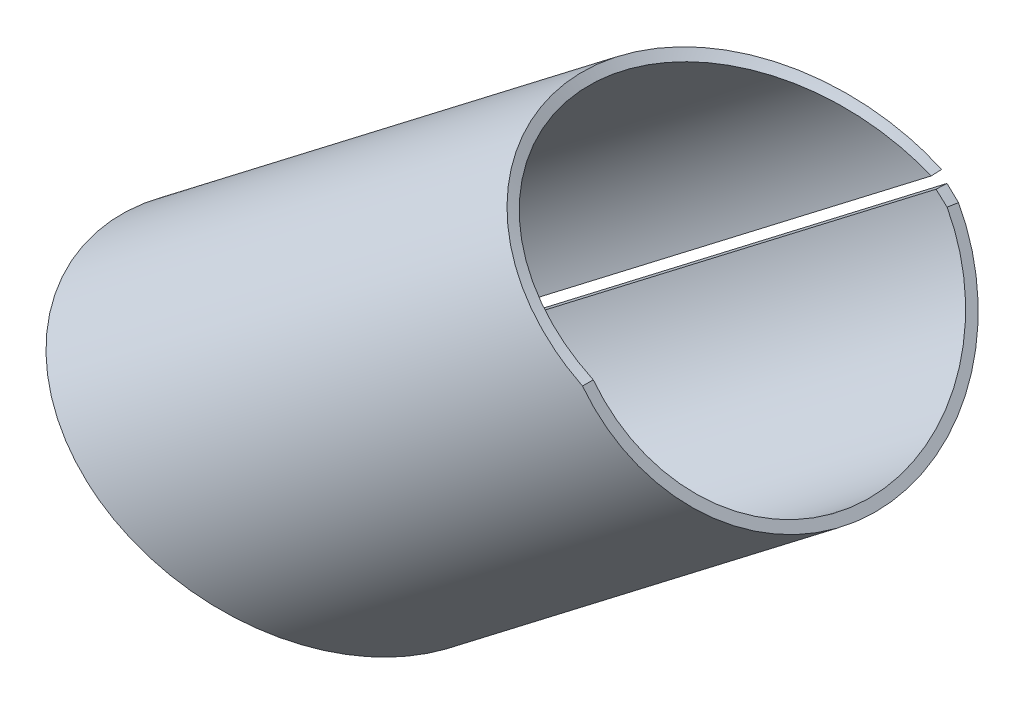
ISO-10303-21;
HEADER;
FILE_DESCRIPTION(('STEP AP214'),'2;1');
FILE_NAME('part.step','',(''),(''),'','','');
FILE_SCHEMA(('AUTOMOTIVE_DESIGN { 1 0 10303 214 1 1 1 1 }'));
ENDSEC;
DATA;
#1=APPLICATION_CONTEXT('core data for automotive mechanical design processes');
#2=APPLICATION_PROTOCOL_DEFINITION('international standard','automotive_design',2000,#1);
#3=PRODUCT_CONTEXT('',#1,'mechanical');
#4=PRODUCT('Part','Part','',(#3));
#5=PRODUCT_RELATED_PRODUCT_CATEGORY('part','',(#4));
#6=PRODUCT_DEFINITION_FORMATION('','',#4);
#7=PRODUCT_DEFINITION_CONTEXT('part definition',#1,'design');
#8=PRODUCT_DEFINITION('design','',#6,#7);
#9=PRODUCT_DEFINITION_SHAPE('','',#8);
#10=(LENGTH_UNIT() NAMED_UNIT(*) SI_UNIT(.MILLI.,.METRE.));
#11=(NAMED_UNIT(*) PLANE_ANGLE_UNIT() SI_UNIT($,.RADIAN.));
#12=(NAMED_UNIT(*) SI_UNIT($,.STERADIAN.) SOLID_ANGLE_UNIT());
#13=UNCERTAINTY_MEASURE_WITH_UNIT(LENGTH_MEASURE(1.E-05),#10,'distance_accuracy_value','');
#14=(GEOMETRIC_REPRESENTATION_CONTEXT(3) GLOBAL_UNCERTAINTY_ASSIGNED_CONTEXT((#13)) GLOBAL_UNIT_ASSIGNED_CONTEXT((#10,
#11,#12)) REPRESENTATION_CONTEXT('',''));
#15=CARTESIAN_POINT('',(0.,0.,0.));
#16=DIRECTION('',(0.,0.,1.));
#17=DIRECTION('',(1.,0.,0.));
#18=AXIS2_PLACEMENT_3D('',#15,#16,#17);
#19=CARTESIAN_POINT('',(0.,-0.630303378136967,-16.9698156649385));
#20=CARTESIAN_POINT('',(0.393203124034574,-0.932486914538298,-16.9556987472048));
#21=CARTESIAN_POINT('',(0.786040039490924,-1.23419425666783,-16.9212786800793));
#22=CARTESIAN_POINT('',(1.17747015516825,-1.53406782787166,-16.8666785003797));
#23=CARTESIAN_POINT('',(-0.0179320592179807,-0.606940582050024,-15.970249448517));
#24=CARTESIAN_POINT('',(0.358087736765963,-0.886736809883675,-15.9569640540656));
#25=CARTESIAN_POINT('',(0.733762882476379,-1.16608492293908,-15.924571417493));
#26=CARTESIAN_POINT('',(1.1081141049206,-1.44370724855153,-15.873187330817));
#27=B_SPLINE_SURFACE_WITH_KNOTS('',1,3,((#19,#20,#21,#22),(#23,#24,#25,#26)),.UNSPECIFIED.,.F.,
.F.,.F.,(2,2),(4,4),(0.,1.),(0.,1.),.UNSPECIFIED.);
#28=CARTESIAN_POINT('',(0.,-0.630303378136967,-16.9698156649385));
#29=CARTESIAN_POINT('',(-0.0179320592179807,-0.606940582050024,-15.970249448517));
#30=B_SPLINE_CURVE_WITH_KNOTS('',1,(#28,#29),.UNSPECIFIED.,.F.,.F.,(2,2),(0.,1.),.UNSPECIFIED.);
#31=CARTESIAN_POINT('',(-0.0179320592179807,-0.606940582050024,-15.970249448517));
#32=VERTEX_POINT('',#31);
#33=CARTESIAN_POINT('',(0.,-0.630303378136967,-16.9698156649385));
#34=VERTEX_POINT('',#33);
#35=EDGE_CURVE('E13',#32,#34,#30,.F.);
#36=CARTESIAN_POINT('',(-0.0179320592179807,-0.606940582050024,-15.970249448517));
#37=CARTESIAN_POINT('',(0.358087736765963,-0.886736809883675,-15.9569640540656));
#38=CARTESIAN_POINT('',(0.733762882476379,-1.16608492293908,-15.924571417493));
#39=CARTESIAN_POINT('',(1.1081141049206,-1.44370724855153,-15.873187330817));
#40=B_SPLINE_CURVE_WITH_KNOTS('',3,(#36,#37,#38,#39),.UNSPECIFIED.,.F.,.F.,(4,4),(0.,1.),.UNSPECIFIED.);
#41=CARTESIAN_POINT('',(1.10811410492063,-1.44370724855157,-15.873187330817));
#42=VERTEX_POINT('',#41);
#43=EDGE_CURVE('E198',#32,#42,#40,.T.);
#44=CARTESIAN_POINT('',(1.1081141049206,-1.44370724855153,-15.873187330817));
#45=CARTESIAN_POINT('',(1.17747015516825,-1.53406782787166,-16.8666785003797));
#46=B_SPLINE_CURVE_WITH_KNOTS('',1,(#44,#45),.UNSPECIFIED.,.F.,.F.,(2,2),(0.,1.),.UNSPECIFIED.);
#47=CARTESIAN_POINT('',(1.17747015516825,-1.53406782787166,-16.8666785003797));
#48=VERTEX_POINT('',#47);
#49=EDGE_CURVE('E52',#42,#48,#46,.T.);
#50=CARTESIAN_POINT('',(1.17747015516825,-1.53406782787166,-16.8666785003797));
#51=CARTESIAN_POINT('',(0.786040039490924,-1.23419425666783,-16.9212786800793));
#52=CARTESIAN_POINT('',(0.393203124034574,-0.932486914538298,-16.9556987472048));
#53=CARTESIAN_POINT('',(0.,-0.630303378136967,-16.9698156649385));
#54=B_SPLINE_CURVE_WITH_KNOTS('',3,(#50,#51,#52,#53),.UNSPECIFIED.,.F.,.F.,(4,4),(0.,1.),.UNSPECIFIED.);
#55=EDGE_CURVE('E126',#34,#48,#54,.F.);
#56=ORIENTED_EDGE('',*,*,#35,.F.);
#57=ORIENTED_EDGE('',*,*,#43,.T.);
#58=ORIENTED_EDGE('',*,*,#49,.T.);
#59=ORIENTED_EDGE('',*,*,#55,.F.);
#60=EDGE_LOOP('',(#56,#57,#58,#59));
#61=FACE_BOUND('',#60,.T.);
#62=ADVANCED_FACE('F40',(#61),#27,.T.);
#63=CARTESIAN_POINT('',(0.,0.,0.));
#64=DIRECTION('',(-0.793268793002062,-0.608871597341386,0.));
#65=DIRECTION('',(0.608871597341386,-0.793268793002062,0.));
#66=AXIS2_PLACEMENT_3D('',#63,#64,#65);
#67=PLANE('',#66);
#68=ORIENTED_EDGE('',*,*,#49,.F.);
#69=CARTESIAN_POINT('',(0.,0.,0.));
#70=DIRECTION('',(0.793268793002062,0.608871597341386,0.));
#71=DIRECTION('',(-0.608871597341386,0.793268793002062,0.));
#72=AXIS2_PLACEMENT_3D('',#69,#70,#71);
#73=CIRCLE('',#72,15.9771800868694);
#74=CARTESIAN_POINT('',(0.,0.,15.9771800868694));
#75=VERTEX_POINT('',#74);
#76=EDGE_CURVE('E109',#75,#42,#73,.T.);
#77=ORIENTED_EDGE('',*,*,#76,.F.);
#78=CARTESIAN_POINT('',(0.,0.,16.9771800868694));
#79=CARTESIAN_POINT('',(0.,0.,15.9771800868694));
#80=B_SPLINE_CURVE_WITH_KNOTS('',1,(#78,#79),.UNSPECIFIED.,.F.,.F.,(2,2),(0.,1.),.UNSPECIFIED.);
#81=CARTESIAN_POINT('',(0.,0.,16.9771800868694));
#82=VERTEX_POINT('',#81);
#83=EDGE_CURVE('E104',#75,#82,#80,.F.);
#84=ORIENTED_EDGE('',*,*,#83,.T.);
#85=CARTESIAN_POINT('',(0.,0.,0.));
#86=DIRECTION('',(-0.793268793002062,-0.608871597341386,0.));
#87=DIRECTION('',(0.608871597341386,-0.793268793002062,0.));
#88=AXIS2_PLACEMENT_3D('',#85,#86,#87);
#89=CIRCLE('',#88,16.9771800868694);
#90=EDGE_CURVE('E108',#82,#48,#89,.F.);
#91=ORIENTED_EDGE('',*,*,#90,.T.);
#92=EDGE_LOOP('',(#68,#77,#84,#91));
#93=FACE_BOUND('',#92,.T.);
#94=ADVANCED_FACE('F107',(#93),#67,.F.);
#95=CARTESIAN_POINT('',(0.,0.,16.9771800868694));
#96=CARTESIAN_POINT('',(-0.794757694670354,0.391869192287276,16.9771800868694));
#97=CARTESIAN_POINT('',(-1.47386024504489,0.727247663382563,16.9225347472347));
#98=CARTESIAN_POINT('',(-2.31783726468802,1.1431843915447,16.8205601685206));
#99=CARTESIAN_POINT('',(-2.57008486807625,1.26740000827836,16.7830194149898));
#100=CARTESIAN_POINT('',(-2.90510568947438,1.43242573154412,16.7271528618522));
#101=CARTESIAN_POINT('',(-3.00931285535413,1.48376883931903,16.7086360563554));
#102=CARTESIAN_POINT('',(-3.20433361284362,1.57992567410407,16.6723342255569));
#103=CARTESIAN_POINT('',(-3.30086446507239,1.62752744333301,16.6534806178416));
#104=CARTESIAN_POINT('',(-4.16079188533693,2.05160857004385,16.4778814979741));
#105=CARTESIAN_POINT('',(-4.86200297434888,2.39743983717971,16.2800029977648));
#106=CARTESIAN_POINT('',(-5.65923504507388,2.79039887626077,16.0070468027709));
#107=CARTESIAN_POINT('',(-5.8147303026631,2.86704103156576,15.9511577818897));
#108=CARTESIAN_POINT('',(-6.11785730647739,3.01647659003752,15.8373785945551));
#109=CARTESIAN_POINT('',(-6.26547900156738,3.08926970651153,15.779516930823));
#110=CARTESIAN_POINT('',(-6.70395838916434,3.30549515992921,15.6006653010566));
#111=CARTESIAN_POINT('',(-6.98795135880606,3.44555499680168,15.4753116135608));
#112=CARTESIAN_POINT('',(-7.81482162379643,3.85329533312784,15.0838865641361));
#113=CARTESIAN_POINT('',(-8.33254763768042,4.108481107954,14.802502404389));
#114=CARTESIAN_POINT('',(-9.05920473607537,4.46675321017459,14.3608969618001));
#115=CARTESIAN_POINT('',(-9.2937769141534,4.58243873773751,14.2100667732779));
#116=CARTESIAN_POINT('',(-9.75167670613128,4.80824226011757,13.8998040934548));
#117=CARTESIAN_POINT('',(-9.97440668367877,4.91807074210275,13.7407266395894));
#118=CARTESIAN_POINT('',(-10.6239130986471,5.23830539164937,13.2532534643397));
#119=CARTESIAN_POINT('',(-11.0319865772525,5.43943543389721,12.9146384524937));
#120=CARTESIAN_POINT('',(-11.798652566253,5.8174719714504,12.2181802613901));
#121=CARTESIAN_POINT('',(-12.1594699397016,5.99544781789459,11.8584488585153));
#122=CARTESIAN_POINT('',(-12.8402043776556,6.33108967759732,11.1177587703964));
#123=CARTESIAN_POINT('',(-13.1594485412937,6.48844299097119,10.7373946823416));
#124=CARTESIAN_POINT('',(-13.755891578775,6.78247602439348,9.96188661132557));
#125=CARTESIAN_POINT('',(-14.0331804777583,6.91924554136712,9.56675970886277));
#126=CARTESIAN_POINT('',(-14.55051112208,7.17435691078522,8.7598387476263));
#127=CARTESIAN_POINT('',(-14.7899385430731,7.29239878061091,8.34879981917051));
#128=CARTESIAN_POINT('',(-15.2303493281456,7.50949625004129,7.51547568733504));
#129=CARTESIAN_POINT('',(-15.4310228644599,7.60839073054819,7.09398128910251));
#130=CARTESIAN_POINT('',(-15.7959205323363,7.78844667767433,6.23910542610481));
#131=CARTESIAN_POINT('',(-15.9601856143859,7.86959457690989,5.80546653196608));
#132=CARTESIAN_POINT('',(-16.3980129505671,8.08585521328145,4.49067040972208));
#133=CARTESIAN_POINT('',(-16.6165284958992,8.19368222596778,3.59566125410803));
#134=CARTESIAN_POINT('',(-16.8340445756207,8.30063786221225,2.24400828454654));
#135=CARTESIAN_POINT('',(-16.8881937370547,8.32718499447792,1.79192826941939));
#136=CARTESIAN_POINT('',(-16.9599766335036,8.36232638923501,0.887709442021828));
#137=CARTESIAN_POINT('',(-16.9776121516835,8.37093331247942,0.436336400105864));
#138=CARTESIAN_POINT('',(-16.9762559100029,8.37041240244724,-0.919224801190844));
#139=CARTESIAN_POINT('',(-16.9027722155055,8.33460705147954,-1.82768226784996));
#140=CARTESIAN_POINT('',(-16.6090187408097,8.18996043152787,-3.63040509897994));
#141=CARTESIAN_POINT('',(-16.3887428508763,8.08111120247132,-4.52464923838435));
#142=CARTESIAN_POINT('',(-15.9488245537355,7.86382272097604,-5.83692919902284));
#143=CARTESIAN_POINT('',(-15.7841494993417,7.782532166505,-6.26902024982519));
#144=CARTESIAN_POINT('',(-15.4178007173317,7.60192012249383,-7.12256560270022));
#145=CARTESIAN_POINT('',(-15.2155971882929,7.50226821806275,-7.54526417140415));
#146=CARTESIAN_POINT('',(-14.5516357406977,7.1749316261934,-8.79560219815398));
#147=CARTESIAN_POINT('',(-14.032404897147,6.91870702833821,-9.60554542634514));
#148=CARTESIAN_POINT('',(-13.1396554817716,6.478648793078,-10.7615359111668));
#149=CARTESIAN_POINT('',(-12.8219011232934,6.32202596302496,-11.1387326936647));
#150=CARTESIAN_POINT('',(-12.1451180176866,5.98831928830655,-11.8730342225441));
#151=CARTESIAN_POINT('',(-11.7871731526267,5.81179088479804,-12.2291931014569));
#152=CARTESIAN_POINT('',(-11.0225818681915,5.43488651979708,-12.9225326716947));
#153=CARTESIAN_POINT('',(-10.6165319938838,5.23472223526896,-13.2589688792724));
#154=CARTESIAN_POINT('',(-9.75675596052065,4.81075081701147,-13.9038738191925));
#155=CARTESIAN_POINT('',(-9.30521955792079,4.58804223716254,-14.2111479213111));
#156=CARTESIAN_POINT('',(-8.33936512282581,4.11186488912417,-14.7985893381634));
#157=CARTESIAN_POINT('',(-7.8258124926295,3.85865555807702,-15.0779100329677));
#158=CARTESIAN_POINT('',(-7.14559059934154,3.52324393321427,-15.400887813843));
#159=CARTESIAN_POINT('',(-7.0076352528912,3.45522063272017,-15.4641717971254));
#160=CARTESIAN_POINT('',(-6.72791557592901,3.3173089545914,-15.5879011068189));
#161=CARTESIAN_POINT('',(-6.58657569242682,3.24763198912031,-15.6481764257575));
#162=CARTESIAN_POINT('',(-6.15298626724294,3.03390773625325,-15.825985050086));
#163=CARTESIAN_POINT('',(-5.85123071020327,2.88518057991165,-15.9404136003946));
#164=CARTESIAN_POINT('',(-5.22217814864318,2.57504276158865,-16.1574297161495));
#165=CARTESIAN_POINT('',(-4.89487971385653,2.4136302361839,-16.2600166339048));
#166=CARTESIAN_POINT('',(-4.38482115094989,2.16205767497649,-16.4020905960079));
#167=CARTESIAN_POINT('',(-4.21161827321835,2.07662686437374,-16.4474787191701));
#168=CARTESIAN_POINT('',(-3.9470624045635,1.946151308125,-16.5122222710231));
#169=CARTESIAN_POINT('',(-3.85808531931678,1.90227140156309,-16.5332468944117));
#170=CARTESIAN_POINT('',(-3.67855308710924,1.81374268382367,-16.574117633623));
#171=CARTESIAN_POINT('',(-3.58902689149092,1.76959719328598,-16.593754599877));
#172=CARTESIAN_POINT('',(-3.12137906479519,1.539103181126,-16.6921348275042));
#173=CARTESIAN_POINT('',(-2.68501515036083,1.32424174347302,-16.7710228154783));
#174=CARTESIAN_POINT('',(-1.68652372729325,0.831928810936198,-16.9006725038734));
#175=CARTESIAN_POINT('',(-1.12441174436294,0.554427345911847,-16.9514173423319));
#176=CARTESIAN_POINT('',(-0.499999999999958,0.246529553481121,-16.9698156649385));
#177=CARTESIAN_POINT('',(0.,0.,15.9771800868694));
#178=CARTESIAN_POINT('',(-0.76624875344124,0.354730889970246,15.9771800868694));
#179=CARTESIAN_POINT('',(-1.42098597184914,0.658360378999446,15.9257534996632));
#180=CARTESIAN_POINT('',(-2.23470001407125,1.03486896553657,15.8297854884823));
#181=CARTESIAN_POINT('',(-2.4779054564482,1.14730399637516,15.7944559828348));
#182=CARTESIAN_POINT('',(-2.80091558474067,1.29668157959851,15.7418801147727));
#183=CARTESIAN_POINT('',(-2.9013865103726,1.34315692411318,15.7244539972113));
#184=CARTESIAN_POINT('',(-3.08941301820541,1.43020129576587,15.6902904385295));
#185=CARTESIAN_POINT('',(-3.18248169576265,1.47329236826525,15.6725473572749));
#186=CARTESIAN_POINT('',(-4.01156612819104,1.85718968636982,15.507291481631));
#187=CARTESIAN_POINT('',(-4.68762626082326,2.17025301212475,15.3210685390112));
#188=CARTESIAN_POINT('',(-5.45626981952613,2.52596548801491,15.0641901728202));
#189=CARTESIAN_POINT('',(-5.60618912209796,2.59534300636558,15.0115931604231));
#190=CARTESIAN_POINT('',(-5.89844542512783,2.73061566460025,14.9045158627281));
#191=CARTESIAN_POINT('',(-6.04077260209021,2.79651081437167,14.8500624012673));
#192=CARTESIAN_POINT('',(-6.46352548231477,2.99224697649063,14.6817455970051));
#193=CARTESIAN_POINT('',(-6.73733231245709,3.11903579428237,14.5637755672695));
#194=CARTESIAN_POINT('',(-7.53454634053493,3.48813848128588,14.1954064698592));
#195=CARTESIAN_POINT('',(-8.03370695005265,3.71913630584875,13.9305965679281));
#196=CARTESIAN_POINT('',(-8.73430349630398,4.04345539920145,13.5150028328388));
#197=CARTESIAN_POINT('',(-8.96046216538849,4.14817938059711,13.3730569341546));
#198=CARTESIAN_POINT('',(-9.4019388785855,4.35258608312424,13.0810695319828));
#199=CARTESIAN_POINT('',(-9.61668057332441,4.45200702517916,12.9313621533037));
#200=CARTESIAN_POINT('',(-10.2428933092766,4.74189348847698,12.4726024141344));
#201=CARTESIAN_POINT('',(-10.6363337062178,4.92395880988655,12.153932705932));
#202=CARTESIAN_POINT('',(-11.3755031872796,5.26617150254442,11.4984977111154));
#203=CARTESIAN_POINT('',(-11.7233781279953,5.42728529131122,11.1599554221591));
#204=CARTESIAN_POINT('',(-12.3796986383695,5.73111944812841,10.4628939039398));
#205=CARTESIAN_POINT('',(-12.6874948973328,5.87355785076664,10.1049342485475));
#206=CARTESIAN_POINT('',(-13.2625484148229,6.1397235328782,9.37510561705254));
#207=CARTESIAN_POINT('',(-13.5298911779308,6.26353471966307,9.0032527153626));
#208=CARTESIAN_POINT('',(-14.0286671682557,6.49447214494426,8.24386149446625));
#209=CARTESIAN_POINT('',(-14.25950802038,6.60132699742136,7.85703382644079));
#210=CARTESIAN_POINT('',(-14.6841253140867,6.79784790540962,7.07279465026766));
#211=CARTESIAN_POINT('',(-14.8776032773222,6.88736762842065,6.6761273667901));
#212=CARTESIAN_POINT('',(-15.2294102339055,7.0503683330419,5.87160591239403));
#213=CARTESIAN_POINT('',(-15.3877796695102,7.12383508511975,5.46350947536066));
#214=CARTESIAN_POINT('',(-15.809893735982,7.31962367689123,4.22615825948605));
#215=CARTESIAN_POINT('',(-16.0205699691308,7.41723723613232,3.38386746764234));
#216=CARTESIAN_POINT('',(-16.2302933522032,7.51404015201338,2.11183036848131));
#217=CARTESIAN_POINT('',(-16.282504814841,7.5380627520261,1.68637904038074));
#218=CARTESIAN_POINT('',(-16.3517204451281,7.56985938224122,0.835421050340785));
#219=CARTESIAN_POINT('',(-16.3687259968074,7.57764555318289,0.410635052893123));
#220=CARTESIAN_POINT('',(-16.3674141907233,7.57718253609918,-0.865080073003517));
#221=CARTESIAN_POINT('',(-16.296553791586,7.54479494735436,-1.72002703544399));
#222=CARTESIAN_POINT('',(-16.0133300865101,7.41386704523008,-3.41656480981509));
#223=CARTESIAN_POINT('',(-15.8009610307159,7.31531924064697,-4.2581356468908));
#224=CARTESIAN_POINT('',(-15.3768309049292,7.11860038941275,-5.49311890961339));
#225=CARTESIAN_POINT('',(-15.2180645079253,7.04500793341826,-5.89975867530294));
#226=CARTESIAN_POINT('',(-14.8648539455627,6.8815130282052,-6.70302799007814));
#227=CARTESIAN_POINT('',(-14.669900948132,6.7913074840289,-7.10082851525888));
#228=CARTESIAN_POINT('',(-14.0297508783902,6.4949935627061,-8.27751838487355));
#229=CARTESIAN_POINT('',(-13.5291478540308,6.26303823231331,-9.03975385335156));
#230=CARTESIAN_POINT('',(-12.6684126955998,5.86468979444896,-10.1276534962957));
#231=CARTESIAN_POINT('',(-12.3620529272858,5.72291241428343,-10.4826324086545));
#232=CARTESIAN_POINT('',(-11.7095424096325,5.42082929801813,-11.1736816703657));
#233=CARTESIAN_POINT('',(-11.3644360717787,5.26102757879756,-11.5088618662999));
#234=CARTESIAN_POINT('',(-10.6272637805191,4.91984606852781,-12.1613619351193));
#235=CARTESIAN_POINT('',(-10.2357753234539,4.73865313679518,-12.4779811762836));
#236=CARTESIAN_POINT('',(-9.40683585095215,4.35485715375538,-13.0848995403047));
#237=CARTESIAN_POINT('',(-8.97149552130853,4.15324963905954,-13.3740743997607));
#238=CARTESIAN_POINT('',(-8.04027929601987,3.72220070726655,-13.9269139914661));
#239=CARTESIAN_POINT('',(-7.54514470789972,3.49298733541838,-14.1897819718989));
#240=CARTESIAN_POINT('',(-6.88931899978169,3.18936029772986,-14.4937355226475));
#241=CARTESIAN_POINT('',(-6.75631139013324,3.12778315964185,-14.5532919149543));
#242=CARTESIAN_POINT('',(-6.48662342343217,3.00294130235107,-14.6697332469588));
#243=CARTESIAN_POINT('',(-6.35035223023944,2.9398680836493,-14.7264581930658));
#244=CARTESIAN_POINT('',(-5.93231137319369,2.74640129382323,-14.8937934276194));
#245=CARTESIAN_POINT('',(-5.64137641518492,2.61177176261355,-15.0014818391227));
#246=CARTESIAN_POINT('',(-5.0348836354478,2.33102597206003,-15.2057151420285));
#247=CARTESIAN_POINT('',(-4.71932446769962,2.1849079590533,-15.3022594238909));
#248=CARTESIAN_POINT('',(-4.22756108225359,1.95717128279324,-15.4359648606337));
#249=CARTESIAN_POINT('',(-4.0605708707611,1.8798346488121,-15.4786795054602));
#250=CARTESIAN_POINT('',(-3.80550402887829,1.76172187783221,-15.5396094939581));
#251=CARTESIAN_POINT('',(-3.71971828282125,1.72199980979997,-15.5593957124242));
#252=CARTESIAN_POINT('',(-3.54662506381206,1.64186016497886,-15.5978590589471));
#253=CARTESIAN_POINT('',(-3.46030975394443,1.60189797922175,-15.6163393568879));
#254=CARTESIAN_POINT('',(-3.00943131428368,1.39325197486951,-15.7089247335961));
#255=CARTESIAN_POINT('',(-2.58870890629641,1.19876908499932,-15.7831660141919));
#256=CARTESIAN_POINT('',(-1.6260274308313,0.753111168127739,-15.9051789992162));
#257=CARTESIAN_POINT('',(-1.08408291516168,0.501886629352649,-15.9529348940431));
#258=CARTESIAN_POINT('',(-0.482067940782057,0.223166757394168,-15.970249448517));
#259=B_SPLINE_SURFACE_WITH_KNOTS('',1,3,((#95,#96,#97,#98,#99,#100,#101,#102,#103,#104,#105,
#106,#107,#108,#109,#110,#111,#112,#113,#114,#115,#116,#117,#118,#119,#120,#121,#122,#123,#124,
#125,#126,#127,#128,#129,#130,#131,#132,#133,#134,#135,#136,#137,#138,#139,#140,#141,#142,#143,
#144,#145,#146,#147,#148,#149,#150,#151,#152,#153,#154,#155,#156,#157,#158,#159,#160,#161,#162,
#163,#164,#165,#166,#167,#168,#169,#170,#171,#172,#173,#174,#175,#176),(#177,#178,#179,#180,
#181,#182,#183,#184,#185,#186,#187,#188,#189,#190,#191,#192,#193,#194,#195,#196,#197,#198,#199,
#200,#201,#202,#203,#204,#205,#206,#207,#208,#209,#210,#211,#212,#213,#214,#215,#216,#217,#218,
#219,#220,#221,#222,#223,#224,#225,#226,#227,#228,#229,#230,#231,#232,#233,#234,#235,#236,#237,
#238,#239,#240,#241,#242,#243,#244,#245,#246,#247,#248,#249,#250,#251,#252,#253,#254,#255,#256,
#257,#258)),.UNSPECIFIED.,.F.,.F.,.F.,(2,2),(4,2,2,2,2,2,2,2,2,2,2,2,2,2,2,2,2,2,2,2,2,2,2,2,2,
2,2,2,2,2,2,2,2,2,2,2,2,2,2,2,4),(0.,1.),(0.,0.015625,0.0234375,0.02734375,0.03125,0.0625,
0.0703125,0.078125,0.09375,0.125,0.140625,0.15625,0.1875,0.21875,0.25,0.28125,0.3125,0.34375,
0.375,0.4375,0.46875,0.5,0.5625,0.625,0.65625,0.6875,0.75,0.78125,0.8125,0.84375,0.875,0.90625,
0.9140625,0.921875,0.9375,0.953125,0.9609375,0.96484375,0.96875,0.984375,1.),.UNSPECIFIED.);
#260=CARTESIAN_POINT('',(0.,0.,15.9771800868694));
#261=CARTESIAN_POINT('',(-0.76624875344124,0.354730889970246,15.9771800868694));
#262=CARTESIAN_POINT('',(-1.42098597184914,0.658360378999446,15.9257534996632));
#263=CARTESIAN_POINT('',(-2.23470001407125,1.03486896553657,15.8297854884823));
#264=CARTESIAN_POINT('',(-2.4779054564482,1.14730399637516,15.7944559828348));
#265=CARTESIAN_POINT('',(-2.80091558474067,1.29668157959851,15.7418801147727));
#266=CARTESIAN_POINT('',(-2.9013865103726,1.34315692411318,15.7244539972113));
#267=CARTESIAN_POINT('',(-3.08941301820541,1.43020129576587,15.6902904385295));
#268=CARTESIAN_POINT('',(-3.18248169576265,1.47329236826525,15.6725473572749));
#269=CARTESIAN_POINT('',(-4.01156612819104,1.85718968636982,15.507291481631));
#270=CARTESIAN_POINT('',(-4.68762626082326,2.17025301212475,15.3210685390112));
#271=CARTESIAN_POINT('',(-5.45626981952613,2.52596548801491,15.0641901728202));
#272=CARTESIAN_POINT('',(-5.60618912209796,2.59534300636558,15.0115931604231));
#273=CARTESIAN_POINT('',(-5.89844542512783,2.73061566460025,14.9045158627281));
#274=CARTESIAN_POINT('',(-6.04077260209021,2.79651081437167,14.8500624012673));
#275=CARTESIAN_POINT('',(-6.46352548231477,2.99224697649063,14.6817455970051));
#276=CARTESIAN_POINT('',(-6.73733231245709,3.11903579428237,14.5637755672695));
#277=CARTESIAN_POINT('',(-7.53454634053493,3.48813848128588,14.1954064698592));
#278=CARTESIAN_POINT('',(-8.03370695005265,3.71913630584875,13.9305965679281));
#279=CARTESIAN_POINT('',(-8.73430349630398,4.04345539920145,13.5150028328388));
#280=CARTESIAN_POINT('',(-8.96046216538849,4.14817938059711,13.3730569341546));
#281=CARTESIAN_POINT('',(-9.4019388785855,4.35258608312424,13.0810695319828));
#282=CARTESIAN_POINT('',(-9.61668057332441,4.45200702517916,12.9313621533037));
#283=CARTESIAN_POINT('',(-10.2428933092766,4.74189348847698,12.4726024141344));
#284=CARTESIAN_POINT('',(-10.6363337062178,4.92395880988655,12.153932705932));
#285=CARTESIAN_POINT('',(-11.3755031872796,5.26617150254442,11.4984977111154));
#286=CARTESIAN_POINT('',(-11.7233781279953,5.42728529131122,11.1599554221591));
#287=CARTESIAN_POINT('',(-12.3796986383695,5.73111944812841,10.4628939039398));
#288=CARTESIAN_POINT('',(-12.6874948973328,5.87355785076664,10.1049342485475));
#289=CARTESIAN_POINT('',(-13.2625484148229,6.1397235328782,9.37510561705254));
#290=CARTESIAN_POINT('',(-13.5298911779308,6.26353471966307,9.0032527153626));
#291=CARTESIAN_POINT('',(-14.0286671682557,6.49447214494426,8.24386149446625));
#292=CARTESIAN_POINT('',(-14.25950802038,6.60132699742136,7.85703382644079));
#293=CARTESIAN_POINT('',(-14.6841253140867,6.79784790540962,7.07279465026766));
#294=CARTESIAN_POINT('',(-14.8776032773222,6.88736762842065,6.6761273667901));
#295=CARTESIAN_POINT('',(-15.2294102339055,7.0503683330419,5.87160591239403));
#296=CARTESIAN_POINT('',(-15.3877796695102,7.12383508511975,5.46350947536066));
#297=CARTESIAN_POINT('',(-15.809893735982,7.31962367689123,4.22615825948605));
#298=CARTESIAN_POINT('',(-16.0205699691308,7.41723723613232,3.38386746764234));
#299=CARTESIAN_POINT('',(-16.2302933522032,7.51404015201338,2.11183036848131));
#300=CARTESIAN_POINT('',(-16.282504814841,7.5380627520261,1.68637904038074));
#301=CARTESIAN_POINT('',(-16.3517204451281,7.56985938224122,0.835421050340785));
#302=CARTESIAN_POINT('',(-16.3687259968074,7.57764555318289,0.410635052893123));
#303=CARTESIAN_POINT('',(-16.3674141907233,7.57718253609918,-0.865080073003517));
#304=CARTESIAN_POINT('',(-16.296553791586,7.54479494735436,-1.72002703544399));
#305=CARTESIAN_POINT('',(-16.0133300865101,7.41386704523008,-3.41656480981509));
#306=CARTESIAN_POINT('',(-15.8009610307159,7.31531924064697,-4.2581356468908));
#307=CARTESIAN_POINT('',(-15.3768309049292,7.11860038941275,-5.49311890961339));
#308=CARTESIAN_POINT('',(-15.2180645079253,7.04500793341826,-5.89975867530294));
#309=CARTESIAN_POINT('',(-14.8648539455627,6.8815130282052,-6.70302799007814));
#310=CARTESIAN_POINT('',(-14.669900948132,6.7913074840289,-7.10082851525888));
#311=CARTESIAN_POINT('',(-14.0297508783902,6.4949935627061,-8.27751838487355));
#312=CARTESIAN_POINT('',(-13.5291478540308,6.26303823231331,-9.03975385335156));
#313=CARTESIAN_POINT('',(-12.6684126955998,5.86468979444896,-10.1276534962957));
#314=CARTESIAN_POINT('',(-12.3620529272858,5.72291241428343,-10.4826324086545));
#315=CARTESIAN_POINT('',(-11.7095424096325,5.42082929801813,-11.1736816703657));
#316=CARTESIAN_POINT('',(-11.3644360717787,5.26102757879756,-11.5088618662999));
#317=CARTESIAN_POINT('',(-10.6272637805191,4.91984606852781,-12.1613619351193));
#318=CARTESIAN_POINT('',(-10.2357753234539,4.73865313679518,-12.4779811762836));
#319=CARTESIAN_POINT('',(-9.40683585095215,4.35485715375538,-13.0848995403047));
#320=CARTESIAN_POINT('',(-8.97149552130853,4.15324963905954,-13.3740743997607));
#321=CARTESIAN_POINT('',(-8.04027929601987,3.72220070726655,-13.9269139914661));
#322=CARTESIAN_POINT('',(-7.54514470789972,3.49298733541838,-14.1897819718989));
#323=CARTESIAN_POINT('',(-6.88931899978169,3.18936029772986,-14.4937355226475));
#324=CARTESIAN_POINT('',(-6.75631139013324,3.12778315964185,-14.5532919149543));
#325=CARTESIAN_POINT('',(-6.48662342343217,3.00294130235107,-14.6697332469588));
#326=CARTESIAN_POINT('',(-6.35035223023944,2.9398680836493,-14.7264581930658));
#327=CARTESIAN_POINT('',(-5.93231137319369,2.74640129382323,-14.8937934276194));
#328=CARTESIAN_POINT('',(-5.64137641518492,2.61177176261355,-15.0014818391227));
#329=CARTESIAN_POINT('',(-5.0348836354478,2.33102597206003,-15.2057151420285));
#330=CARTESIAN_POINT('',(-4.71932446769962,2.1849079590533,-15.3022594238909));
#331=CARTESIAN_POINT('',(-4.22756108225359,1.95717128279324,-15.4359648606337));
#332=CARTESIAN_POINT('',(-4.0605708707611,1.8798346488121,-15.4786795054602));
#333=CARTESIAN_POINT('',(-3.80550402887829,1.76172187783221,-15.5396094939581));
#334=CARTESIAN_POINT('',(-3.71971828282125,1.72199980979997,-15.5593957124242));
#335=CARTESIAN_POINT('',(-3.54662506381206,1.64186016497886,-15.5978590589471));
#336=CARTESIAN_POINT('',(-3.46030975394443,1.60189797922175,-15.6163393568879));
#337=CARTESIAN_POINT('',(-3.00943131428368,1.39325197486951,-15.7089247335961));
#338=CARTESIAN_POINT('',(-2.58870890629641,1.19876908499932,-15.7831660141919));
#339=CARTESIAN_POINT('',(-1.6260274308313,0.753111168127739,-15.9051789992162));
#340=CARTESIAN_POINT('',(-1.08408291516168,0.501886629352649,-15.9529348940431));
#341=CARTESIAN_POINT('',(-0.482067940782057,0.223166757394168,-15.970249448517));
#342=B_SPLINE_CURVE_WITH_KNOTS('',3,(#260,#261,#262,#263,#264,#265,#266,#267,#268,#269,#270,
#271,#272,#273,#274,#275,#276,#277,#278,#279,#280,#281,#282,#283,#284,#285,#286,#287,#288,#289,
#290,#291,#292,#293,#294,#295,#296,#297,#298,#299,#300,#301,#302,#303,#304,#305,#306,#307,#308,
#309,#310,#311,#312,#313,#314,#315,#316,#317,#318,#319,#320,#321,#322,#323,#324,#325,#326,#327,
#328,#329,#330,#331,#332,#333,#334,#335,#336,#337,#338,#339,#340,#341),.UNSPECIFIED.,.F.,.F.,(4,
2,2,2,2,2,2,2,2,2,2,2,2,2,2,2,2,2,2,2,2,2,2,2,2,2,2,2,2,2,2,2,2,2,2,2,2,2,2,2,4),(0.,0.015625,
0.0234375,0.02734375,0.03125,0.0625,0.0703125,0.078125,0.09375,0.125,0.140625,0.15625,0.1875,
0.21875,0.25,0.28125,0.3125,0.34375,0.375,0.4375,0.46875,0.5,0.5625,0.625,0.65625,0.6875,0.75,
0.78125,0.8125,0.84375,0.875,0.90625,0.9140625,0.921875,0.9375,0.953125,0.9609375,0.96484375,
0.96875,0.984375,1.),.UNSPECIFIED.);
#343=CARTESIAN_POINT('',(-0.48206794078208,0.223166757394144,-15.970249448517));
#344=VERTEX_POINT('',#343);
#345=EDGE_CURVE('E191',#75,#344,#342,.T.);
#346=CARTESIAN_POINT('',(-0.482067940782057,0.223166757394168,-15.970249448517));
#347=CARTESIAN_POINT('',(-0.499999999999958,0.246529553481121,-16.9698156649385));
#348=B_SPLINE_CURVE_WITH_KNOTS('',1,(#346,#347),.UNSPECIFIED.,.F.,.F.,(2,2),(0.,1.),.UNSPECIFIED.);
#349=CARTESIAN_POINT('',(-0.499999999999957,0.246529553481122,-16.9698156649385));
#350=VERTEX_POINT('',#349);
#351=EDGE_CURVE('E115',#344,#350,#348,.T.);
#352=CARTESIAN_POINT('',(-0.499999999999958,0.246529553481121,-16.9698156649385));
#353=CARTESIAN_POINT('',(-1.12441174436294,0.554427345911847,-16.9514173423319));
#354=CARTESIAN_POINT('',(-1.68652372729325,0.831928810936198,-16.9006725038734));
#355=CARTESIAN_POINT('',(-2.68501515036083,1.32424174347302,-16.7710228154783));
#356=CARTESIAN_POINT('',(-3.12137906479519,1.539103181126,-16.6921348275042));
#357=CARTESIAN_POINT('',(-3.58902689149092,1.76959719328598,-16.593754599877));
#358=CARTESIAN_POINT('',(-3.67855308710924,1.81374268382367,-16.574117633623));
#359=CARTESIAN_POINT('',(-3.85808531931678,1.90227140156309,-16.5332468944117));
#360=CARTESIAN_POINT('',(-3.9470624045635,1.946151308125,-16.5122222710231));
#361=CARTESIAN_POINT('',(-4.21161827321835,2.07662686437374,-16.4474787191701));
#362=CARTESIAN_POINT('',(-4.38482115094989,2.16205767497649,-16.4020905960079));
#363=CARTESIAN_POINT('',(-4.89487971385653,2.4136302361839,-16.2600166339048));
#364=CARTESIAN_POINT('',(-5.22217814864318,2.57504276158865,-16.1574297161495));
#365=CARTESIAN_POINT('',(-5.85123071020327,2.88518057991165,-15.9404136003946));
#366=CARTESIAN_POINT('',(-6.15298626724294,3.03390773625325,-15.825985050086));
#367=CARTESIAN_POINT('',(-6.58657569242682,3.24763198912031,-15.6481764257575));
#368=CARTESIAN_POINT('',(-6.72791557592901,3.3173089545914,-15.5879011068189));
#369=CARTESIAN_POINT('',(-7.0076352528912,3.45522063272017,-15.4641717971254));
#370=CARTESIAN_POINT('',(-7.14559059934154,3.52324393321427,-15.400887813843));
#371=CARTESIAN_POINT('',(-7.8258124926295,3.85865555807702,-15.0779100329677));
#372=CARTESIAN_POINT('',(-8.33936512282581,4.11186488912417,-14.7985893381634));
#373=CARTESIAN_POINT('',(-9.30521955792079,4.58804223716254,-14.2111479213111));
#374=CARTESIAN_POINT('',(-9.75675596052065,4.81075081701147,-13.9038738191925));
#375=CARTESIAN_POINT('',(-10.6165319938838,5.23472223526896,-13.2589688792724));
#376=CARTESIAN_POINT('',(-11.0225818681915,5.43488651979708,-12.9225326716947));
#377=CARTESIAN_POINT('',(-11.7871731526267,5.81179088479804,-12.2291931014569));
#378=CARTESIAN_POINT('',(-12.1451180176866,5.98831928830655,-11.8730342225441));
#379=CARTESIAN_POINT('',(-12.8219011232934,6.32202596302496,-11.1387326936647));
#380=CARTESIAN_POINT('',(-13.1396554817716,6.478648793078,-10.7615359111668));
#381=CARTESIAN_POINT('',(-14.032404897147,6.91870702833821,-9.60554542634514));
#382=CARTESIAN_POINT('',(-14.5516357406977,7.1749316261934,-8.79560219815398));
#383=CARTESIAN_POINT('',(-15.2155971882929,7.50226821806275,-7.54526417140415));
#384=CARTESIAN_POINT('',(-15.4178007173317,7.60192012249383,-7.12256560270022));
#385=CARTESIAN_POINT('',(-15.7841494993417,7.782532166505,-6.26902024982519));
#386=CARTESIAN_POINT('',(-15.9488245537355,7.86382272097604,-5.83692919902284));
#387=CARTESIAN_POINT('',(-16.3887428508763,8.08111120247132,-4.52464923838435));
#388=CARTESIAN_POINT('',(-16.6090187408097,8.18996043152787,-3.63040509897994));
#389=CARTESIAN_POINT('',(-16.9027722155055,8.33460705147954,-1.82768226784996));
#390=CARTESIAN_POINT('',(-16.9762559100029,8.37041240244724,-0.919224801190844));
#391=CARTESIAN_POINT('',(-16.9776121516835,8.37093331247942,0.436336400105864));
#392=CARTESIAN_POINT('',(-16.9599766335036,8.36232638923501,0.887709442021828));
#393=CARTESIAN_POINT('',(-16.8881937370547,8.32718499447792,1.79192826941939));
#394=CARTESIAN_POINT('',(-16.8340445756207,8.30063786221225,2.24400828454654));
#395=CARTESIAN_POINT('',(-16.6165284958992,8.19368222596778,3.59566125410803));
#396=CARTESIAN_POINT('',(-16.3980129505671,8.08585521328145,4.49067040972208));
#397=CARTESIAN_POINT('',(-15.9601856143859,7.86959457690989,5.80546653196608));
#398=CARTESIAN_POINT('',(-15.7959205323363,7.78844667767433,6.23910542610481));
#399=CARTESIAN_POINT('',(-15.4310228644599,7.60839073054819,7.09398128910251));
#400=CARTESIAN_POINT('',(-15.2303493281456,7.50949625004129,7.51547568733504));
#401=CARTESIAN_POINT('',(-14.7899385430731,7.29239878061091,8.34879981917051));
#402=CARTESIAN_POINT('',(-14.55051112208,7.17435691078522,8.7598387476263));
#403=CARTESIAN_POINT('',(-14.0331804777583,6.91924554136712,9.56675970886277));
#404=CARTESIAN_POINT('',(-13.755891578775,6.78247602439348,9.96188661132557));
#405=CARTESIAN_POINT('',(-13.1594485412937,6.48844299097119,10.7373946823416));
#406=CARTESIAN_POINT('',(-12.8402043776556,6.33108967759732,11.1177587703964));
#407=CARTESIAN_POINT('',(-12.1594699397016,5.99544781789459,11.8584488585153));
#408=CARTESIAN_POINT('',(-11.798652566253,5.8174719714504,12.2181802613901));
#409=CARTESIAN_POINT('',(-11.0319865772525,5.43943543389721,12.9146384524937));
#410=CARTESIAN_POINT('',(-10.6239130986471,5.23830539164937,13.2532534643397));
#411=CARTESIAN_POINT('',(-9.97440668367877,4.91807074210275,13.7407266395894));
#412=CARTESIAN_POINT('',(-9.75167670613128,4.80824226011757,13.8998040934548));
#413=CARTESIAN_POINT('',(-9.2937769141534,4.58243873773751,14.2100667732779));
#414=CARTESIAN_POINT('',(-9.05920473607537,4.46675321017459,14.3608969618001));
#415=CARTESIAN_POINT('',(-8.33254763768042,4.108481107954,14.802502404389));
#416=CARTESIAN_POINT('',(-7.81482162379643,3.85329533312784,15.0838865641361));
#417=CARTESIAN_POINT('',(-6.98795135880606,3.44555499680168,15.4753116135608));
#418=CARTESIAN_POINT('',(-6.70395838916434,3.30549515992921,15.6006653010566));
#419=CARTESIAN_POINT('',(-6.26547900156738,3.08926970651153,15.779516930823));
#420=CARTESIAN_POINT('',(-6.11785730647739,3.01647659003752,15.8373785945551));
#421=CARTESIAN_POINT('',(-5.8147303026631,2.86704103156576,15.9511577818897));
#422=CARTESIAN_POINT('',(-5.65923504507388,2.79039887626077,16.0070468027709));
#423=CARTESIAN_POINT('',(-4.86200297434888,2.39743983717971,16.2800029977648));
#424=CARTESIAN_POINT('',(-4.16079188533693,2.05160857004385,16.4778814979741));
#425=CARTESIAN_POINT('',(-3.30086446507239,1.62752744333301,16.6534806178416));
#426=CARTESIAN_POINT('',(-3.20433361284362,1.57992567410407,16.6723342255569));
#427=CARTESIAN_POINT('',(-3.00931285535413,1.48376883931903,16.7086360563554));
#428=CARTESIAN_POINT('',(-2.90510568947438,1.43242573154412,16.7271528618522));
#429=CARTESIAN_POINT('',(-2.57008486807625,1.26740000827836,16.7830194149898));
#430=CARTESIAN_POINT('',(-2.31783726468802,1.1431843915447,16.8205601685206));
#431=CARTESIAN_POINT('',(-1.47386024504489,0.727247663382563,16.9225347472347));
#432=CARTESIAN_POINT('',(-0.794757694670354,0.391869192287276,16.9771800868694));
#433=CARTESIAN_POINT('',(0.,0.,16.9771800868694));
#434=B_SPLINE_CURVE_WITH_KNOTS('',3,(#352,#353,#354,#355,#356,#357,#358,#359,#360,#361,#362,
#363,#364,#365,#366,#367,#368,#369,#370,#371,#372,#373,#374,#375,#376,#377,#378,#379,#380,#381,
#382,#383,#384,#385,#386,#387,#388,#389,#390,#391,#392,#393,#394,#395,#396,#397,#398,#399,#400,
#401,#402,#403,#404,#405,#406,#407,#408,#409,#410,#411,#412,#413,#414,#415,#416,#417,#418,#419,
#420,#421,#422,#423,#424,#425,#426,#427,#428,#429,#430,#431,#432,#433),.UNSPECIFIED.,.F.,.F.,(4,
2,2,2,2,2,2,2,2,2,2,2,2,2,2,2,2,2,2,2,2,2,2,2,2,2,2,2,2,2,2,2,2,2,2,2,2,2,2,2,4),(0.,0.015625,
0.03125,0.03515625,0.0390625,0.046875,0.0625,0.078125,0.0859375,0.09375,0.125,0.15625,0.1875,
0.21875,0.25,0.3125,0.34375,0.375,0.4375,0.5,0.53125,0.5625,0.625,0.65625,0.6875,0.71875,0.75,
0.78125,0.8125,0.84375,0.859375,0.875,0.90625,0.921875,0.9296875,0.9375,0.96875,0.97265625,
0.9765625,0.984375,1.),.UNSPECIFIED.);
#435=EDGE_CURVE('E123',#82,#350,#434,.F.);
#436=ORIENTED_EDGE('',*,*,#83,.F.);
#437=ORIENTED_EDGE('',*,*,#345,.T.);
#438=ORIENTED_EDGE('',*,*,#351,.T.);
#439=ORIENTED_EDGE('',*,*,#435,.F.);
#440=EDGE_LOOP('',(#436,#437,#438,#439));
#441=FACE_BOUND('',#440,.T.);
#442=ADVANCED_FACE('F130',(#441),#259,.T.);
#443=CARTESIAN_POINT('',(-21.9509471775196,-16.2552210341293,-15.970249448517));
#444=DIRECTION('',(-0.608607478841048,0.792924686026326,0.0294512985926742));
#445=DIRECTION('',(0.793268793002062,0.608871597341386,0.));
#446=AXIS2_PLACEMENT_3D('',#443,#444,#445);
#447=PLANE('',#446);
#448=ORIENTED_EDGE('',*,*,#351,.F.);
#449=DIRECTION('',(0.793268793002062,0.608871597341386,0.));
#450=VECTOR('',#449,1.);
#451=CARTESIAN_POINT('',(-43.4198264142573,-32.7336088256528,-15.970249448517));
#452=LINE('',#451,#450);
#453=CARTESIAN_POINT('',(-43.4198264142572,-32.7336088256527,-15.970249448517));
#454=VERTEX_POINT('',#453);
#455=EDGE_CURVE('E187',#454,#344,#452,.T.);
#456=ORIENTED_EDGE('',*,*,#455,.F.);
#457=CARTESIAN_POINT('',(-43.4377584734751,-32.7102460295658,-16.9698156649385));
#458=CARTESIAN_POINT('',(-43.4198264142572,-32.7336088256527,-15.970249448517));
#459=B_SPLINE_CURVE_WITH_KNOTS('',1,(#457,#458),.UNSPECIFIED.,.F.,.F.,(2,2),(0.,1.),.UNSPECIFIED.);
#460=CARTESIAN_POINT('',(-43.4377584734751,-32.7102460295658,-16.9698156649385));
#461=VERTEX_POINT('',#460);
#462=EDGE_CURVE('E98',#454,#461,#459,.F.);
#463=ORIENTED_EDGE('',*,*,#462,.T.);
#464=DIRECTION('',(-0.793268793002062,-0.608871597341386,0.));
#465=VECTOR('',#464,1.);
#466=CARTESIAN_POINT('',(120.092105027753,92.8067162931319,-16.9698156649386));
#467=LINE('',#466,#465);
#468=EDGE_CURVE('E132',#461,#350,#467,.F.);
#469=ORIENTED_EDGE('',*,*,#468,.T.);
#470=EDGE_LOOP('',(#448,#456,#463,#469));
#471=FACE_BOUND('',#470,.T.);
#472=ADVANCED_FACE('F153',(#471),#447,.F.);
#473=CARTESIAN_POINT('',(-43.4377584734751,-32.7102460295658,-16.9698156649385));
#474=CARTESIAN_POINT('',(-44.0676227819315,-32.3996565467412,-16.9512566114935));
#475=CARTESIAN_POINT('',(-44.633714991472,-32.120192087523,-16.8998049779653));
#476=CARTESIAN_POINT('',(-45.6372309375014,-31.6254149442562,-16.7687802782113));
#477=CARTESIAN_POINT('',(-46.0746396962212,-31.4100489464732,-16.6892244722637));
#478=CARTESIAN_POINT('',(-46.5418082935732,-31.1797698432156,-16.5904975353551));
#479=CARTESIAN_POINT('',(-46.6315013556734,-31.1355378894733,-16.5707390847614));
#480=CARTESIAN_POINT('',(-46.8113573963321,-31.0468442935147,-16.5296181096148));
#481=CARTESIAN_POINT('',(-46.9004762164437,-31.00289262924,-16.5084705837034));
#482=CARTESIAN_POINT('',(-47.1653971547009,-30.8722333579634,-16.4433680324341));
#483=CARTESIAN_POINT('',(-47.3387632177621,-30.7867221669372,-16.3977535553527));
#484=CARTESIAN_POINT('',(-47.8490743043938,-30.5350301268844,-16.2550627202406));
#485=CARTESIAN_POINT('',(-48.1762248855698,-30.3737003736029,-16.1521480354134));
#486=CARTESIAN_POINT('',(-48.804373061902,-30.0640220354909,-15.9347539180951));
#487=CARTESIAN_POINT('',(-49.1053721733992,-29.9156714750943,-15.8202751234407));
#488=CARTESIAN_POINT('',(-49.5373914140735,-29.7027052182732,-15.6426687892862));
#489=CARTESIAN_POINT('',(-49.6782178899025,-29.6332723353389,-15.5824731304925));
#490=CARTESIAN_POINT('',(-49.9569641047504,-29.4958292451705,-15.4589112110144));
#491=CARTESIAN_POINT('',(-50.0944359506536,-29.428040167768,-15.3957250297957));
#492=CARTESIAN_POINT('',(-50.7722580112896,-29.0937973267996,-15.0733052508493));
#493=CARTESIAN_POINT('',(-51.2839476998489,-28.8415150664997,-14.7946519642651));
#494=CARTESIAN_POINT('',(-52.2462228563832,-28.3671332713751,-14.2089436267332));
#495=CARTESIAN_POINT('',(-52.6960526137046,-28.1452892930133,-13.9027353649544));
#496=CARTESIAN_POINT('',(-53.5528641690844,-27.7227924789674,-13.2600584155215));
#497=CARTESIAN_POINT('',(-53.957615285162,-27.5232638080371,-12.9248121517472));
#498=CARTESIAN_POINT('',(-54.7199657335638,-27.1474406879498,-12.2339141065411));
#499=CARTESIAN_POINT('',(-55.0769431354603,-26.9713703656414,-11.8790315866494));
#500=CARTESIAN_POINT('',(-55.7521858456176,-26.6383761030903,-11.1472130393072));
#501=CARTESIAN_POINT('',(-56.0695087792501,-26.4819293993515,-10.7710266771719));
#502=CARTESIAN_POINT('',(-56.6636042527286,-26.1890763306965,-10.0030234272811));
#503=CARTESIAN_POINT('',(-56.9399040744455,-26.0528722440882,-9.61193402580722));
#504=CARTESIAN_POINT('',(-57.4548446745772,-25.798935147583,-8.81490826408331));
#505=CARTESIAN_POINT('',(-57.6936738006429,-25.6811543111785,-8.40857439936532));
#506=CARTESIAN_POINT('',(-58.1339680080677,-25.464074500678,-7.58396927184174));
#507=CARTESIAN_POINT('',(-58.3354336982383,-25.3647747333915,-7.16569895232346));
#508=CARTESIAN_POINT('',(-58.7011306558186,-25.1844881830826,-6.32078410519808));
#509=CARTESIAN_POINT('',(-58.8657517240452,-25.1032417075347,-5.89324980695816));
#510=CARTESIAN_POINT('',(-59.6005116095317,-24.7403426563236,-3.7286867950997));
#511=CARTESIAN_POINT('',(-59.9006463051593,-24.5927756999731,-1.92009662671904));
#512=CARTESIAN_POINT('',(-59.9178712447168,-24.5846101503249,0.319255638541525));
#513=CARTESIAN_POINT('',(-59.9035610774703,-24.5916044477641,0.766242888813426));
#514=CARTESIAN_POINT('',(-59.8391351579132,-24.6231328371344,1.66213398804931));
#515=CARTESIAN_POINT('',(-59.7890100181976,-24.6476921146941,2.11019226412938));
#516=CARTESIAN_POINT('',(-59.5845865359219,-24.7481610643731,3.45034012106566));
#517=CARTESIAN_POINT('',(-59.3761632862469,-24.8509619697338,4.33842660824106));
#518=CARTESIAN_POINT('',(-58.9553999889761,-25.0587876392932,5.64449258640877));
#519=CARTESIAN_POINT('',(-58.7971430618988,-25.136975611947,6.07549698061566));
#520=CARTESIAN_POINT('',(-58.4448723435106,-25.3108537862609,6.92574104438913));
#521=CARTESIAN_POINT('',(-58.2510688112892,-25.4063900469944,7.34464853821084));
#522=CARTESIAN_POINT('',(-57.8250868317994,-25.6163684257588,8.17358438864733));
#523=CARTESIAN_POINT('',(-57.5931888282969,-25.7306819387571,8.58285138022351));
#524=CARTESIAN_POINT('',(-57.0914969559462,-25.9780642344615,9.38718061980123));
#525=CARTESIAN_POINT('',(-56.8221569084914,-26.1109248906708,9.78166191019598));
#526=CARTESIAN_POINT('',(-55.9543287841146,-26.5388084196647,10.9419375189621));
#527=CARTESIAN_POINT('',(-55.2928157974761,-26.8648722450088,11.6883293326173));
#528=CARTESIAN_POINT('',(-54.1755714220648,-27.4158753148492,12.7356547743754));
#529=CARTESIAN_POINT('',(-53.7795211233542,-27.6110774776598,13.0753335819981));
#530=CARTESIAN_POINT('',(-52.9370057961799,-28.0264252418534,13.7303432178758));
#531=CARTESIAN_POINT('',(-52.4909565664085,-28.2463871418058,14.0452883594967));
#532=CARTESIAN_POINT('',(-51.7847890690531,-28.5946399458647,14.4924793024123));
#533=CARTESIAN_POINT('',(-51.5423316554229,-28.7141792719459,14.6379264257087));
#534=CARTESIAN_POINT('',(-51.0395302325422,-28.962045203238,14.9220747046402));
#535=CARTESIAN_POINT('',(-50.7797265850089,-29.0901190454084,15.0604358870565));
#536=CARTESIAN_POINT('',(-50.2432527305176,-29.3546275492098,15.3278497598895));
#537=CARTESIAN_POINT('',(-49.9665821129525,-29.4910627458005,15.456902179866));
#538=CARTESIAN_POINT('',(-49.538951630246,-29.7019531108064,15.6420126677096));
#539=CARTESIAN_POINT('',(-49.3943048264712,-29.7732884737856,15.702304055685));
#540=CARTESIAN_POINT('',(-49.1008188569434,-29.9180177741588,15.8198063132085));
#541=CARTESIAN_POINT('',(-48.9523093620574,-29.9912479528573,15.8769157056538));
#542=CARTESIAN_POINT('',(-48.186669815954,-30.3686746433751,16.1585519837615));
#543=CARTESIAN_POINT('',(-47.5093906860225,-30.7024937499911,16.3677800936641));
#544=CARTESIAN_POINT('',(-46.581394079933,-31.1601859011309,16.5826568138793));
#545=CARTESIAN_POINT('',(-46.3917377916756,-31.2537284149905,16.6232805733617));
#546=CARTESIAN_POINT('',(-46.1012025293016,-31.3970032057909,16.6801369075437));
#547=CARTESIAN_POINT('',(-46.00517716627,-31.4443601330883,16.6981101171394));
#548=CARTESIAN_POINT('',(-45.7959829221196,-31.5474475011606,16.7351793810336));
#549=CARTESIAN_POINT('',(-45.6840593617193,-31.6025751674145,16.7540011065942));
#550=CARTESIAN_POINT('',(-45.0876595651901,-31.8963285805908,16.8473789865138));
#551=CARTESIAN_POINT('',(-44.4925624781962,-32.1896576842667,16.9208863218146));
#552=CARTESIAN_POINT('',(-43.6008930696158,-32.629652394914,16.9651593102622));
#553=CARTESIAN_POINT('',(-43.4151894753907,-32.7212916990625,16.9715622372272));
#554=CARTESIAN_POINT('',(-43.1256493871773,-32.8641201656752,16.9764147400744));
#555=CARTESIAN_POINT('',(-43.0270612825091,-32.9127425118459,16.9772391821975));
#556=CARTESIAN_POINT('',(-42.8272465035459,-33.0112663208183,16.9771143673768));
#557=CARTESIAN_POINT('',(-42.7291546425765,-33.0596476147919,16.9761714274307));
#558=CARTESIAN_POINT('',(-42.2478152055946,-33.2970960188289,16.96752361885));
#559=CARTESIAN_POINT('',(-41.8919587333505,-33.4727478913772,16.9480871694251));
#560=CARTESIAN_POINT('',(-40.9128314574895,-33.9557447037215,16.8686561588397));
#561=CARTESIAN_POINT('',(-40.3781385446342,-34.2189539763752,16.7884602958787));
#562=CARTESIAN_POINT('',(-39.8559756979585,-34.4762646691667,16.6954653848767));
#563=CARTESIAN_POINT('',(-39.7596464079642,-34.5237689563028,16.6773530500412));
#564=CARTESIAN_POINT('',(-39.5650024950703,-34.6197502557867,16.6390794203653));
#565=CARTESIAN_POINT('',(-39.4686866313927,-34.6672493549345,16.6192538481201));
#566=CARTESIAN_POINT('',(-39.1827675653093,-34.8082586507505,16.5578501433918));
#567=CARTESIAN_POINT('',(-38.9961936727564,-34.9002798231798,16.51434588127));
#568=CARTESIAN_POINT('',(-38.4486407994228,-35.1703200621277,16.3772120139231));
#569=CARTESIAN_POINT('',(-38.0998410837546,-35.3423022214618,16.2769761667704));
#570=CARTESIAN_POINT('',(-37.4347125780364,-35.6701773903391,16.0643195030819));
#571=CARTESIAN_POINT('',(-37.1184030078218,-35.8260632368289,15.9519079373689));
#572=CARTESIAN_POINT('',(-36.5178585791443,-36.1221903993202,15.7198254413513));
#573=CARTESIAN_POINT('',(-36.2261263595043,-36.2660721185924,15.5972597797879));
#574=CARTESIAN_POINT('',(-35.3767214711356,-36.6849478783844,15.2131531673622));
#575=CARTESIAN_POINT('',(-34.8448869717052,-36.9471120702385,14.9352565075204));
#576=CARTESIAN_POINT('',(-34.0985347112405,-37.3150593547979,14.4974348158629));
#577=CARTESIAN_POINT('',(-33.8588688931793,-37.433253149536,14.3483796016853));
#578=CARTESIAN_POINT('',(-33.3910197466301,-37.663976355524,14.0414130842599));
#579=CARTESIAN_POINT('',(-33.1633890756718,-37.7762306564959,13.8837879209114));
#580=CARTESIAN_POINT('',(-32.4994204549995,-38.1036173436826,13.4001340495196));
#581=CARTESIAN_POINT('',(-32.0820263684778,-38.3093468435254,13.063348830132));
#582=CARTESIAN_POINT('',(-31.4935791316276,-38.5994529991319,12.5428704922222));
#583=CARTESIAN_POINT('',(-31.3039315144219,-38.6929806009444,12.3670560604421));
#584=CARTESIAN_POINT('',(-30.9347772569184,-38.8750311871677,12.0090692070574));
#585=CARTESIAN_POINT('',(-30.7555101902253,-38.9634360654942,11.8270890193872));
#586=CARTESIAN_POINT('',(-30.2336675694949,-39.2207524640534,11.2732377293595));
#587=CARTESIAN_POINT('',(-29.9070620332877,-39.3817508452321,10.8934664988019));
#588=CARTESIAN_POINT('',(-29.2962901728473,-39.6828380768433,10.1182123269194));
#589=CARTESIAN_POINT('',(-29.0124223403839,-39.8228353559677,9.72325400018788));
#590=CARTESIAN_POINT('',(-28.4824632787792,-40.084182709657,8.91627708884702));
#591=CARTESIAN_POINT('',(-28.2369142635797,-40.2052523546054,8.50487844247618));
#592=CARTESIAN_POINT('',(-27.7846731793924,-40.4281889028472,7.67025428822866));
#593=CARTESIAN_POINT('',(-27.5782321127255,-40.5299199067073,7.2476425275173));
#594=CARTESIAN_POINT('',(-27.2027883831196,-40.7151314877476,6.39153401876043));
#595=CARTESIAN_POINT('',(-27.0334104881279,-40.7987958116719,5.95703086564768));
#596=CARTESIAN_POINT('',(-26.5807592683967,-41.0223773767,4.6389730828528));
#597=CARTESIAN_POINT('',(-26.353049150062,-41.1347780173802,3.74089722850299));
#598=CARTESIAN_POINT('',(-26.0461482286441,-41.2857447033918,1.93119267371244));
#599=CARTESIAN_POINT('',(-25.9670027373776,-41.324360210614,1.02049345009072));
#600=CARTESIAN_POINT('',(-25.9549088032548,-41.3303258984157,-0.794167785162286));
#601=CARTESIAN_POINT('',(-26.0220187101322,-41.2976495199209,-1.70678794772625));
#602=CARTESIAN_POINT('',(-26.3047483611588,-41.1585638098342,-3.51996864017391));
#603=CARTESIAN_POINT('',(-26.5203413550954,-41.0521164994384,-4.4202851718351));
#604=CARTESIAN_POINT('',(-27.0995043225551,-40.7660374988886,-6.18334455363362));
#605=CARTESIAN_POINT('',(-27.4616638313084,-40.5874378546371,-7.04361053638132));
#606=CARTESIAN_POINT('',(-28.3417941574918,-40.153551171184,-8.72228266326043));
#607=CARTESIAN_POINT('',(-28.8594145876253,-39.8981622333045,-9.53855684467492));
#608=CARTESIAN_POINT('',(-29.7513968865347,-39.4584282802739,-10.7043909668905));
#609=CARTESIAN_POINT('',(-30.068368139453,-39.3022324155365,-11.0839013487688));
#610=CARTESIAN_POINT('',(-30.7446483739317,-38.9687815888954,-11.8238033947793));
#611=CARTESIAN_POINT('',(-31.102345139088,-38.792336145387,-12.1825777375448));
#612=CARTESIAN_POINT('',(-31.8660820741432,-38.4158232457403,-12.8805758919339));
#613=CARTESIAN_POINT('',(-32.2722031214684,-38.215646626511,-13.219670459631));
#614=CARTESIAN_POINT('',(-32.9179695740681,-37.8972330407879,-13.7076449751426));
#615=CARTESIAN_POINT('',(-33.1393178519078,-37.7880765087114,-13.8668536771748));
#616=CARTESIAN_POINT('',(-33.5941734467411,-37.5637606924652,-14.1773489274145));
#617=CARTESIAN_POINT('',(-33.8275564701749,-37.4486718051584,-14.3286013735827));
#618=CARTESIAN_POINT('',(-34.5527611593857,-37.0911297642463,-14.7728527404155));
#619=CARTESIAN_POINT('',(-35.0674757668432,-36.8373636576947,-15.0548562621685));
#620=CARTESIAN_POINT('',(-35.886485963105,-36.4335147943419,-15.4465295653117));
#621=CARTESIAN_POINT('',(-36.1667475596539,-36.2953190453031,-15.5716266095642));
#622=CARTESIAN_POINT('',(-36.7451020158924,-36.0102254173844,-15.8105186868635));
#623=CARTESIAN_POINT('',(-37.0474155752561,-35.8612325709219,-15.9260323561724));
#624=CARTESIAN_POINT('',(-37.6785001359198,-35.5501140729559,-16.1454221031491));
#625=CARTESIAN_POINT('',(-38.0072726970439,-35.3879863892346,-16.249297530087));
#626=CARTESIAN_POINT('',(-38.5202496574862,-35.1349777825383,-16.3933231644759));
#627=CARTESIAN_POINT('',(-38.6945431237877,-35.0490078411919,-16.4393647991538));
#628=CARTESIAN_POINT('',(-38.9609132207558,-34.9176307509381,-16.5050745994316));
#629=CARTESIAN_POINT('',(-39.0505247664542,-34.8734348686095,-16.5264189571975));
#630=CARTESIAN_POINT('',(-39.2313855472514,-34.7842430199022,-16.5679212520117));
#631=CARTESIAN_POINT('',(-39.3218987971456,-34.739606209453,-16.5879248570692));
#632=CARTESIAN_POINT('',(-39.7869086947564,-34.5103609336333,-16.6865586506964));
#633=CARTESIAN_POINT('',(-40.224442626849,-34.2949468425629,-16.7666106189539));
#634=CARTESIAN_POINT('',(-41.2320164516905,-33.7981886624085,-16.898882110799));
#635=CARTESIAN_POINT('',(-41.8020423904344,-33.5167867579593,-16.9510840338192));
#636=CARTESIAN_POINT('',(-42.4377584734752,-33.2033051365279,-16.9698156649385));
#637=CARTESIAN_POINT('',(-43.4198264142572,-32.7336088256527,-15.970249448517));
#638=CARTESIAN_POINT('',(-44.0270982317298,-32.4524521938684,-15.9527836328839));
#639=CARTESIAN_POINT('',(-44.5728802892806,-32.1994506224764,-15.9043625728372));
#640=CARTESIAN_POINT('',(-45.5404064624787,-31.7515627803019,-15.7810555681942));
#641=CARTESIAN_POINT('',(-45.9621365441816,-31.556623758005,-15.7061858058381));
#642=CARTESIAN_POINT('',(-46.4125523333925,-31.3481710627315,-15.6132741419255));
#643=CARTESIAN_POINT('',(-46.4990284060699,-31.3081303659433,-15.5946795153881));
#644=CARTESIAN_POINT('',(-46.6724336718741,-31.227841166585,-15.5559806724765));
#645=CARTESIAN_POINT('',(-46.7583560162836,-31.1880540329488,-15.5360787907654));
#646=CARTESIAN_POINT('',(-47.0137747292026,-31.0697747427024,-15.4748109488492));
#647=CARTESIAN_POINT('',(-47.1809222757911,-30.992365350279,-15.4318832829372));
#648=CARTESIAN_POINT('',(-47.6729292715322,-30.7645208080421,-15.2975973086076));
#649=CARTESIAN_POINT('',(-47.9883461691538,-30.6184782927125,-15.2007445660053));
#650=CARTESIAN_POINT('',(-48.59396738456,-30.338149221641,-14.9961555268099));
#651=CARTESIAN_POINT('',(-48.8841731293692,-30.2038608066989,-14.8884198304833));
#652=CARTESIAN_POINT('',(-49.3006996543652,-30.0110792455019,-14.721274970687));
#653=CARTESIAN_POINT('',(-49.4364755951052,-29.9482264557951,-14.6646249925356));
#654=CARTESIAN_POINT('',(-49.7052246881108,-29.8238081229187,-14.5483411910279));
#655=CARTESIAN_POINT('',(-49.8377660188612,-29.7624427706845,-14.4888768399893));
#656=CARTESIAN_POINT('',(-50.4912775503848,-29.459872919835,-14.1854484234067));
#657=CARTESIAN_POINT('',(-50.9846162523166,-29.2314992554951,-13.9232085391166));
#658=CARTESIAN_POINT('',(-51.9123824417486,-28.8020774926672,-13.3719999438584));
#659=CARTESIAN_POINT('',(-52.3460779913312,-28.6012539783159,-13.0838281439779));
#660=CARTESIAN_POINT('',(-53.1721596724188,-28.2187936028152,-12.4790065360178));
#661=CARTESIAN_POINT('',(-53.5623958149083,-28.0381757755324,-12.1635071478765));
#662=CARTESIAN_POINT('',(-54.2974069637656,-27.6979716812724,-11.5133047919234));
#663=CARTESIAN_POINT('',(-54.6415799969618,-27.5385835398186,-11.1793257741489));
#664=CARTESIAN_POINT('',(-55.292604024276,-27.237142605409,-10.4906132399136));
#665=CARTESIAN_POINT('',(-55.5985467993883,-27.0955225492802,-10.1365852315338));
#666=CARTESIAN_POINT('',(-56.171337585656,-26.8304263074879,-9.41381936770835));
#667=CARTESIAN_POINT('',(-56.4377289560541,-26.707131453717,-9.04576614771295));
#668=CARTESIAN_POINT('',(-56.9342005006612,-26.4772567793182,-8.2956872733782));
#669=CARTESIAN_POINT('',(-57.1644635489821,-26.3706362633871,-7.91328752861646));
#670=CARTESIAN_POINT('',(-57.5889673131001,-26.1741290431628,-7.13725378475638));
#671=CARTESIAN_POINT('',(-57.7832086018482,-26.0842415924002,-6.74362067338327));
#672=CARTESIAN_POINT('',(-58.1357908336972,-25.9210415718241,-5.94847350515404));
#673=CARTESIAN_POINT('',(-58.2945056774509,-25.8474900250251,-5.54612208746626));
#674=CARTESIAN_POINT('',(-59.0028964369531,-25.5189460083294,-3.50905745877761));
#675=CARTESIAN_POINT('',(-59.2922789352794,-25.3853875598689,-1.80699794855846));
#676=CARTESIAN_POINT('',(-59.3088954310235,-25.378014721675,0.300450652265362));
#677=CARTESIAN_POINT('',(-59.295096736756,-25.3843426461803,0.721109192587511));
#678=CARTESIAN_POINT('',(-59.2329746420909,-25.4128694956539,1.56422997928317));
#679=CARTESIAN_POINT('',(-59.184642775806,-25.4350924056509,1.98589645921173));
#680=CARTESIAN_POINT('',(-58.987541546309,-25.5260215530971,3.24710612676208));
#681=CARTESIAN_POINT('',(-58.786594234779,-25.6190824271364,4.08288201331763));
#682=CARTESIAN_POINT('',(-58.3809316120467,-25.8072341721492,5.31201731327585));
#683=CARTESIAN_POINT('',(-58.228354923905,-25.8780216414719,5.71763442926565));
#684=CARTESIAN_POINT('',(-57.8887234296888,-26.0354327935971,6.51779690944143));
#685=CARTESIAN_POINT('',(-57.7018699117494,-26.1219142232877,6.91202966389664));
#686=CARTESIAN_POINT('',(-57.2911638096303,-26.311990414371,7.69213903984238));
#687=CARTESIAN_POINT('',(-57.0675818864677,-26.4154693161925,8.07729914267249));
#688=CARTESIAN_POINT('',(-56.5838832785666,-26.6394090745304,8.83425130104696));
#689=CARTESIAN_POINT('',(-56.3242045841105,-26.7596824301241,9.20549661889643));
#690=CARTESIAN_POINT('',(-55.4875001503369,-27.1470164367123,10.2974289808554));
#691=CARTESIAN_POINT('',(-54.8497088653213,-27.4421744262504,10.9998563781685));
#692=CARTESIAN_POINT('',(-53.7725373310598,-27.9409685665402,11.9854916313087));
#693=CARTESIAN_POINT('',(-53.3906889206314,-28.1176677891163,12.3051624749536));
#694=CARTESIAN_POINT('',(-52.5783878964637,-28.4936508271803,12.9215903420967));
#695=CARTESIAN_POINT('',(-52.1483367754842,-28.6927695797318,13.2179843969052));
#696=CARTESIAN_POINT('',(-51.4674973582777,-29.0080236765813,13.6388346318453));
#697=CARTESIAN_POINT('',(-51.2337352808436,-29.1162342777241,13.7757145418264));
#698=CARTESIAN_POINT('',(-50.7489651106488,-29.3406081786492,14.0431257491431));
#699=CARTESIAN_POINT('',(-50.4984783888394,-29.4565434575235,14.1733370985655));
#700=CARTESIAN_POINT('',(-49.9812445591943,-29.6959850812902,14.4249995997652));
#701=CARTESIAN_POINT('',(-49.7144970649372,-29.819491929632,14.546450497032));
#702=CARTESIAN_POINT('',(-49.3022044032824,-30.0103994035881,14.7206574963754));
#703=CARTESIAN_POINT('',(-49.1627456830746,-30.0749754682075,14.7773975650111));
#704=CARTESIAN_POINT('',(-48.8797859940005,-30.2059905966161,14.8879786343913));
#705=CARTESIAN_POINT('',(-48.7366028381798,-30.2722813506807,14.9417241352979));
#706=CARTESIAN_POINT('',(-47.9984200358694,-30.6139360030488,15.2067713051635));
#707=CARTESIAN_POINT('',(-47.3454275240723,-30.9161132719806,15.4036753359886));
#708=CARTESIAN_POINT('',(-46.4507165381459,-31.3304392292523,15.6058952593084));
#709=CARTESIAN_POINT('',(-46.2678629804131,-31.4151188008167,15.6441261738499));
#710=CARTESIAN_POINT('',(-45.9877481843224,-31.5448172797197,15.6976335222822));
#711=CARTESIAN_POINT('',(-45.8951669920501,-31.5876869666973,15.7145480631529));
#712=CARTESIAN_POINT('',(-45.6934736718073,-31.6810017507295,15.749433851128));
#713=CARTESIAN_POINT('',(-45.5855625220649,-31.7309018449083,15.7671469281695));
#714=CARTESIAN_POINT('',(-45.0105433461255,-31.9967995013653,15.8550246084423));
#715=CARTESIAN_POINT('',(-44.4367863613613,-32.2623256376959,15.9242021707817));
#716=CARTESIAN_POINT('',(-43.5771058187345,-32.6606436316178,15.9658673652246));
#717=CARTESIAN_POINT('',(-43.398064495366,-32.7436029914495,15.9718931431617));
#718=CARTESIAN_POINT('',(-43.1189104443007,-32.8729000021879,15.9764598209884));
#719=CARTESIAN_POINT('',(-43.0238584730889,-32.9169152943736,15.9772357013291));
#720=CARTESIAN_POINT('',(-42.8312099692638,-33.006102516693,15.9771182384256));
#721=CARTESIAN_POINT('',(-42.7366365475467,-33.0498998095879,15.9762308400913));
#722=CARTESIAN_POINT('',(-42.2725633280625,-33.264852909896,15.968092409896));
#723=CARTESIAN_POINT('',(-41.92947484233,-33.4238700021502,15.9498008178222));
#724=CARTESIAN_POINT('',(-40.9854696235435,-33.8611080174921,15.8750485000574));
#725=CARTESIAN_POINT('',(-40.4699408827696,-34.0993492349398,15.7995763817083));
#726=CARTESIAN_POINT('',(-39.966500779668,-34.3322669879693,15.7120591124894));
#727=CARTESIAN_POINT('',(-39.8736264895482,-34.3752699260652,15.6950136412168));
#728=CARTESIAN_POINT('',(-39.6859636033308,-34.4621559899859,15.6589944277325));
#729=CARTESIAN_POINT('',(-39.5931022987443,-34.5051543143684,15.6403366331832));
#730=CARTESIAN_POINT('',(-39.3174384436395,-34.632802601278,15.5825497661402));
#731=CARTESIAN_POINT('',(-39.1375566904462,-34.7161049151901,15.541608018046));
#732=CARTESIAN_POINT('',(-38.6096431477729,-34.9605580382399,15.4125516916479));
#733=CARTESIAN_POINT('',(-38.2733529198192,-35.1162422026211,15.3182199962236));
#734=CARTESIAN_POINT('',(-37.6320765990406,-35.4130415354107,15.1180893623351));
#735=CARTESIAN_POINT('',(-37.3271091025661,-35.5541503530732,15.0122991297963));
#736=CARTESIAN_POINT('',(-36.7481033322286,-35.8222158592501,14.7938868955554));
#737=CARTESIAN_POINT('',(-36.4668349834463,-35.9524647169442,14.6785406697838));
#738=CARTESIAN_POINT('',(-35.6478952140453,-36.3316489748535,14.3170589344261));
#739=CARTESIAN_POINT('',(-35.1351327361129,-36.5689651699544,14.0555311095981));
#740=CARTESIAN_POINT('',(-34.4155463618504,-36.9020405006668,13.6434982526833));
#741=CARTESIAN_POINT('',(-34.184476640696,-37.0090348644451,13.5032227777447));
#742=CARTESIAN_POINT('',(-33.7334077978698,-37.2178958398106,13.2143373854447));
#743=CARTESIAN_POINT('',(-33.5139414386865,-37.3195132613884,13.0659967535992));
#744=CARTESIAN_POINT('',(-32.8737857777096,-37.6158752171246,12.6108313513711));
#745=CARTESIAN_POINT('',(-32.4713591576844,-37.8021043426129,12.293883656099));
#746=CARTESIAN_POINT('',(-31.9040151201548,-38.0647161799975,11.8040628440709));
#747=CARTESIAN_POINT('',(-31.7211696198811,-38.1493816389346,11.6386043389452));
#748=CARTESIAN_POINT('',(-31.3652557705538,-38.3141819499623,11.3017038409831));
#749=CARTESIAN_POINT('',(-31.1924184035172,-38.3942098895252,11.1304427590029));
#750=CARTESIAN_POINT('',(-30.6892916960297,-38.6271422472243,10.6092147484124));
#751=CARTESIAN_POINT('',(-30.374398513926,-38.7728811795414,10.2518130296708));
#752=CARTESIAN_POINT('',(-29.7855297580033,-39.0454319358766,9.52222334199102));
#753=CARTESIAN_POINT('',(-29.5118435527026,-39.1721640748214,9.15052908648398));
#754=CARTESIAN_POINT('',(-29.0008923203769,-39.4087470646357,8.3910852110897));
#755=CARTESIAN_POINT('',(-28.7641496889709,-39.5183433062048,8.00391901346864));
#756=CARTESIAN_POINT('',(-28.3281265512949,-39.7201502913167,7.21845638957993));
#757=CARTESIAN_POINT('',(-28.1290876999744,-39.8122373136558,6.82073755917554));
#758=CARTESIAN_POINT('',(-27.7671116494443,-39.9799025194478,6.01505606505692));
#759=CARTESIAN_POINT('',(-27.6038126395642,-40.0556469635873,5.60614627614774));
#760=CARTESIAN_POINT('',(-27.1674066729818,-40.2580633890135,4.36572551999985));
#761=CARTESIAN_POINT('',(-26.9478667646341,-40.3598194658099,3.52054866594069));
#762=CARTESIAN_POINT('',(-26.6519625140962,-40.4964591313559,1.81744040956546));
#763=CARTESIAN_POINT('',(-26.5756439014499,-40.5313916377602,0.960383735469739));
#764=CARTESIAN_POINT('',(-26.5639837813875,-40.5367921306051,-0.747389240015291));
#765=CARTESIAN_POINT('',(-26.6286985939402,-40.5072362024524,-1.60625370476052));
#766=CARTESIAN_POINT('',(-26.901297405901,-40.3813494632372,-3.31263334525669));
#767=CARTESIAN_POINT('',(-27.1091541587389,-40.2849813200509,-4.15991889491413));
#768=CARTESIAN_POINT('',(-27.6675312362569,-40.0259832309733,-5.81912950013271));
#769=CARTESIAN_POINT('',(-28.0167012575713,-39.8643069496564,-6.62872358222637));
#770=CARTESIAN_POINT('',(-28.8652684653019,-39.4715422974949,-8.20851756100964));
#771=CARTESIAN_POINT('',(-29.3643200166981,-39.2403458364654,-8.97671107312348));
#772=CARTESIAN_POINT('',(-30.224314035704,-38.8422878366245,-10.0738745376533));
#773=CARTESIAN_POINT('',(-30.5299199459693,-38.7008993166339,-10.4310307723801));
#774=CARTESIAN_POINT('',(-31.1819458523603,-38.3990482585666,-11.1273506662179));
#775=CARTESIAN_POINT('',(-31.5268118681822,-38.2393193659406,-11.464992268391));
#776=CARTESIAN_POINT('',(-32.2631596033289,-37.8984905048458,-12.121876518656));
#777=CARTESIAN_POINT('',(-32.654717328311,-37.7172877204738,-12.4409975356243));
#778=CARTESIAN_POINT('',(-33.2773235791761,-37.4290484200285,-12.900229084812));
#779=CARTESIAN_POINT('',(-33.4907328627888,-37.3302352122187,-13.0500599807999));
#780=CARTESIAN_POINT('',(-33.9292741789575,-37.1271744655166,-13.3422662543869));
#781=CARTESIAN_POINT('',(-34.1542866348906,-37.0229911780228,-13.4846095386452));
#782=CARTESIAN_POINT('',(-34.8534832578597,-36.6993337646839,-13.9026933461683));
#783=CARTESIAN_POINT('',(-35.3497386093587,-36.4696173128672,-14.1680861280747));
#784=CARTESIAN_POINT('',(-36.1393749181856,-36.1040382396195,-14.5366888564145));
#785=CARTESIAN_POINT('',(-36.4095848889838,-35.9789382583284,-14.6544173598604));
#786=CARTESIAN_POINT('',(-36.9671991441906,-35.7208660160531,-14.8792380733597));
#787=CARTESIAN_POINT('',(-37.2586723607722,-35.5859965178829,-14.9879476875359));
#788=CARTESIAN_POINT('',(-37.8671248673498,-35.3043642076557,-15.1944148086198));
#789=CARTESIAN_POINT('',(-38.1841056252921,-35.1575994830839,-15.2921717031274));
#790=CARTESIAN_POINT('',(-38.6786828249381,-34.9285630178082,-15.4277138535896));
#791=CARTESIAN_POINT('',(-38.8467244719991,-34.8507382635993,-15.4710435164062));
#792=CARTESIAN_POINT('',(-39.1035402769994,-34.7318089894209,-15.5328828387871));
#793=CARTESIAN_POINT('',(-39.1899376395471,-34.6918007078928,-15.5529699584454));
#794=CARTESIAN_POINT('',(-39.3643115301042,-34.6110603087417,-15.5920276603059));
#795=CARTESIAN_POINT('',(-39.4515783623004,-34.5706530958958,-15.6108530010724));
#796=CARTESIAN_POINT('',(-39.8999120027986,-34.3631344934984,-15.7036770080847));
#797=CARTESIAN_POINT('',(-40.3217631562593,-34.168152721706,-15.7790137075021));
#798=CARTESIAN_POINT('',(-41.2932022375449,-33.7184727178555,-15.9034940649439));
#799=CARTESIAN_POINT('',(-41.8427770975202,-33.4637173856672,-15.9526212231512));
#800=CARTESIAN_POINT('',(-42.4556905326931,-33.1799423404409,-15.970249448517));
#801=B_SPLINE_SURFACE_WITH_KNOTS('',1,3,((#473,#474,#475,#476,#477,#478,#479,#480,#481,#482,
#483,#484,#485,#486,#487,#488,#489,#490,#491,#492,#493,#494,#495,#496,#497,#498,#499,#500,#501,
#502,#503,#504,#505,#506,#507,#508,#509,#510,#511,#512,#513,#514,#515,#516,#517,#518,#519,#520,
#521,#522,#523,#524,#525,#526,#527,#528,#529,#530,#531,#532,#533,#534,#535,#536,#537,#538,#539,
#540,#541,#542,#543,#544,#545,#546,#547,#548,#549,#550,#551,#552,#553,#554,#555,#556,#557,#558,
#559,#560,#561,#562,#563,#564,#565,#566,#567,#568,#569,#570,#571,#572,#573,#574,#575,#576,#577,
#578,#579,#580,#581,#582,#583,#584,#585,#586,#587,#588,#589,#590,#591,#592,#593,#594,#595,#596,
#597,#598,#599,#600,#601,#602,#603,#604,#605,#606,#607,#608,#609,#610,#611,#612,#613,#614,#615,
#616,#617,#618,#619,#620,#621,#622,#623,#624,#625,#626,#627,#628,#629,#630,#631,#632,#633,#634,
#635,#636),(#637,#638,#639,#640,#641,#642,#643,#644,#645,#646,#647,#648,#649,#650,#651,#652,
#653,#654,#655,#656,#657,#658,#659,#660,#661,#662,#663,#664,#665,#666,#667,#668,#669,#670,#671,
#672,#673,#674,#675,#676,#677,#678,#679,#680,#681,#682,#683,#684,#685,#686,#687,#688,#689,#690,
#691,#692,#693,#694,#695,#696,#697,#698,#699,#700,#701,#702,#703,#704,#705,#706,#707,#708,#709,
#710,#711,#712,#713,#714,#715,#716,#717,#718,#719,#720,#721,#722,#723,#724,#725,#726,#727,#728,
#729,#730,#731,#732,#733,#734,#735,#736,#737,#738,#739,#740,#741,#742,#743,#744,#745,#746,#747,
#748,#749,#750,#751,#752,#753,#754,#755,#756,#757,#758,#759,#760,#761,#762,#763,#764,#765,#766,
#767,#768,#769,#770,#771,#772,#773,#774,#775,#776,#777,#778,#779,#780,#781,#782,#783,#784,#785,
#786,#787,#788,#789,#790,#791,#792,#793,#794,#795,#796,#797,#798,#799,#800)),.UNSPECIFIED.,.F.,
.F.,.F.,(2,2),(4,2,2,2,2,2,2,2,2,2,2,2,2,2,2,2,2,2,2,2,2,2,2,2,2,2,2,2,2,2,2,2,2,2,2,2,2,2,2,2,
2,2,2,2,2,2,2,2,2,2,2,2,2,2,2,2,2,2,2,2,2,2,2,2,2,2,2,2,2,2,2,2,2,2,2,2,2,2,2,2,2,4),(0.,1.),
(0.,0.0078125,0.015625,0.017578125,0.01953125,0.0234375,0.03125,0.0390625,0.04296875,0.046875,
0.0625,0.078125,0.09375,0.109375,0.125,0.140625,0.15625,0.171875,0.1875,0.25,0.265625,0.28125,
0.3125,0.328125,0.34375,0.359375,0.375,0.40625,0.421875,0.4375,0.4453125,0.453125,0.4609375,
0.46484375,0.46875,0.484375,0.48828125,0.490234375,0.4921875,0.5,0.501953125,0.5029296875,
0.50390625,0.5078125,0.515625,0.517578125,0.51953125,0.5234375,0.53125,0.5390625,0.546875,
0.5625,0.5703125,0.578125,0.59375,0.6015625,0.609375,0.625,0.640625,0.65625,0.671875,0.6875,
0.71875,0.75,0.78125,0.8125,0.84375,0.875,0.890625,0.90625,0.921875,0.9296875,0.9375,0.953125,
0.9609375,0.96875,0.9765625,0.98046875,0.982421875,0.984375,0.9921875,1.),.UNSPECIFIED.);
#802=CARTESIAN_POINT('',(-43.4198264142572,-32.7336088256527,-15.970249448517));
#803=CARTESIAN_POINT('',(-44.0270982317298,-32.4524521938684,-15.9527836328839));
#804=CARTESIAN_POINT('',(-44.5728802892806,-32.1994506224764,-15.9043625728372));
#805=CARTESIAN_POINT('',(-45.5404064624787,-31.7515627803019,-15.7810555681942));
#806=CARTESIAN_POINT('',(-45.9621365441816,-31.556623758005,-15.7061858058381));
#807=CARTESIAN_POINT('',(-46.4125523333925,-31.3481710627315,-15.6132741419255));
#808=CARTESIAN_POINT('',(-46.4990284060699,-31.3081303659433,-15.5946795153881));
#809=CARTESIAN_POINT('',(-46.6724336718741,-31.227841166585,-15.5559806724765));
#810=CARTESIAN_POINT('',(-46.7583560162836,-31.1880540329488,-15.5360787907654));
#811=CARTESIAN_POINT('',(-47.0137747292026,-31.0697747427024,-15.4748109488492));
#812=CARTESIAN_POINT('',(-47.1809222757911,-30.992365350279,-15.4318832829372));
#813=CARTESIAN_POINT('',(-47.6729292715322,-30.7645208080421,-15.2975973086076));
#814=CARTESIAN_POINT('',(-47.9883461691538,-30.6184782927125,-15.2007445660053));
#815=CARTESIAN_POINT('',(-48.59396738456,-30.338149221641,-14.9961555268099));
#816=CARTESIAN_POINT('',(-48.8841731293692,-30.2038608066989,-14.8884198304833));
#817=CARTESIAN_POINT('',(-49.3006996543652,-30.0110792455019,-14.721274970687));
#818=CARTESIAN_POINT('',(-49.4364755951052,-29.9482264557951,-14.6646249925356));
#819=CARTESIAN_POINT('',(-49.7052246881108,-29.8238081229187,-14.5483411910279));
#820=CARTESIAN_POINT('',(-49.8377660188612,-29.7624427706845,-14.4888768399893));
#821=CARTESIAN_POINT('',(-50.4912775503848,-29.459872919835,-14.1854484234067));
#822=CARTESIAN_POINT('',(-50.9846162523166,-29.2314992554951,-13.9232085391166));
#823=CARTESIAN_POINT('',(-51.9123824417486,-28.8020774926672,-13.3719999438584));
#824=CARTESIAN_POINT('',(-52.3460779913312,-28.6012539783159,-13.0838281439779));
#825=CARTESIAN_POINT('',(-53.1721596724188,-28.2187936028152,-12.4790065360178));
#826=CARTESIAN_POINT('',(-53.5623958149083,-28.0381757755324,-12.1635071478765));
#827=CARTESIAN_POINT('',(-54.2974069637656,-27.6979716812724,-11.5133047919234));
#828=CARTESIAN_POINT('',(-54.6415799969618,-27.5385835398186,-11.1793257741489));
#829=CARTESIAN_POINT('',(-55.292604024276,-27.237142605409,-10.4906132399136));
#830=CARTESIAN_POINT('',(-55.5985467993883,-27.0955225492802,-10.1365852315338));
#831=CARTESIAN_POINT('',(-56.171337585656,-26.8304263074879,-9.41381936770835));
#832=CARTESIAN_POINT('',(-56.4377289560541,-26.707131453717,-9.04576614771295));
#833=CARTESIAN_POINT('',(-56.9342005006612,-26.4772567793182,-8.2956872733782));
#834=CARTESIAN_POINT('',(-57.1644635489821,-26.3706362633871,-7.91328752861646));
#835=CARTESIAN_POINT('',(-57.5889673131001,-26.1741290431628,-7.13725378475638));
#836=CARTESIAN_POINT('',(-57.7832086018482,-26.0842415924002,-6.74362067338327));
#837=CARTESIAN_POINT('',(-58.1357908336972,-25.9210415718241,-5.94847350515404));
#838=CARTESIAN_POINT('',(-58.2945056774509,-25.8474900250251,-5.54612208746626));
#839=CARTESIAN_POINT('',(-59.0028964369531,-25.5189460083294,-3.50905745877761));
#840=CARTESIAN_POINT('',(-59.2922789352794,-25.3853875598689,-1.80699794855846));
#841=CARTESIAN_POINT('',(-59.3088954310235,-25.378014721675,0.300450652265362));
#842=CARTESIAN_POINT('',(-59.295096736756,-25.3843426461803,0.721109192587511));
#843=CARTESIAN_POINT('',(-59.2329746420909,-25.4128694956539,1.56422997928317));
#844=CARTESIAN_POINT('',(-59.184642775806,-25.4350924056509,1.98589645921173));
#845=CARTESIAN_POINT('',(-58.987541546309,-25.5260215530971,3.24710612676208));
#846=CARTESIAN_POINT('',(-58.786594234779,-25.6190824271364,4.08288201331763));
#847=CARTESIAN_POINT('',(-58.3809316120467,-25.8072341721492,5.31201731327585));
#848=CARTESIAN_POINT('',(-58.228354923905,-25.8780216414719,5.71763442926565));
#849=CARTESIAN_POINT('',(-57.8887234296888,-26.0354327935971,6.51779690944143));
#850=CARTESIAN_POINT('',(-57.7018699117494,-26.1219142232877,6.91202966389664));
#851=CARTESIAN_POINT('',(-57.2911638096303,-26.311990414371,7.69213903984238));
#852=CARTESIAN_POINT('',(-57.0675818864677,-26.4154693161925,8.07729914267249));
#853=CARTESIAN_POINT('',(-56.5838832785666,-26.6394090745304,8.83425130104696));
#854=CARTESIAN_POINT('',(-56.3242045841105,-26.7596824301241,9.20549661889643));
#855=CARTESIAN_POINT('',(-55.4875001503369,-27.1470164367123,10.2974289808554));
#856=CARTESIAN_POINT('',(-54.8497088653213,-27.4421744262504,10.9998563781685));
#857=CARTESIAN_POINT('',(-53.7725373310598,-27.9409685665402,11.9854916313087));
#858=CARTESIAN_POINT('',(-53.3906889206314,-28.1176677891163,12.3051624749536));
#859=CARTESIAN_POINT('',(-52.5783878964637,-28.4936508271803,12.9215903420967));
#860=CARTESIAN_POINT('',(-52.1483367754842,-28.6927695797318,13.2179843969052));
#861=CARTESIAN_POINT('',(-51.4674973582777,-29.0080236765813,13.6388346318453));
#862=CARTESIAN_POINT('',(-51.2337352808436,-29.1162342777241,13.7757145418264));
#863=CARTESIAN_POINT('',(-50.7489651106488,-29.3406081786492,14.0431257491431));
#864=CARTESIAN_POINT('',(-50.4984783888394,-29.4565434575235,14.1733370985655));
#865=CARTESIAN_POINT('',(-49.9812445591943,-29.6959850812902,14.4249995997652));
#866=CARTESIAN_POINT('',(-49.7144970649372,-29.819491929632,14.546450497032));
#867=CARTESIAN_POINT('',(-49.3022044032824,-30.0103994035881,14.7206574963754));
#868=CARTESIAN_POINT('',(-49.1627456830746,-30.0749754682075,14.7773975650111));
#869=CARTESIAN_POINT('',(-48.8797859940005,-30.2059905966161,14.8879786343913));
#870=CARTESIAN_POINT('',(-48.7366028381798,-30.2722813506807,14.9417241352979));
#871=CARTESIAN_POINT('',(-47.9984200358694,-30.6139360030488,15.2067713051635));
#872=CARTESIAN_POINT('',(-47.3454275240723,-30.9161132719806,15.4036753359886));
#873=CARTESIAN_POINT('',(-46.4507165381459,-31.3304392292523,15.6058952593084));
#874=CARTESIAN_POINT('',(-46.2678629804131,-31.4151188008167,15.6441261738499));
#875=CARTESIAN_POINT('',(-45.9877481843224,-31.5448172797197,15.6976335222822));
#876=CARTESIAN_POINT('',(-45.8951669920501,-31.5876869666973,15.7145480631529));
#877=CARTESIAN_POINT('',(-45.6934736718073,-31.6810017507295,15.749433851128));
#878=CARTESIAN_POINT('',(-45.5855625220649,-31.7309018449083,15.7671469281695));
#879=CARTESIAN_POINT('',(-45.0105433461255,-31.9967995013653,15.8550246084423));
#880=CARTESIAN_POINT('',(-44.4367863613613,-32.2623256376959,15.9242021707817));
#881=CARTESIAN_POINT('',(-43.5771058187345,-32.6606436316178,15.9658673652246));
#882=CARTESIAN_POINT('',(-43.398064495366,-32.7436029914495,15.9718931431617));
#883=CARTESIAN_POINT('',(-43.1189104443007,-32.8729000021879,15.9764598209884));
#884=CARTESIAN_POINT('',(-43.0238584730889,-32.9169152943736,15.9772357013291));
#885=CARTESIAN_POINT('',(-42.8312099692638,-33.006102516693,15.9771182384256));
#886=CARTESIAN_POINT('',(-42.7366365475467,-33.0498998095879,15.9762308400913));
#887=CARTESIAN_POINT('',(-42.2725633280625,-33.264852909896,15.968092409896));
#888=CARTESIAN_POINT('',(-41.92947484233,-33.4238700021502,15.9498008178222));
#889=CARTESIAN_POINT('',(-40.9854696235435,-33.8611080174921,15.8750485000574));
#890=CARTESIAN_POINT('',(-40.4699408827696,-34.0993492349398,15.7995763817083));
#891=CARTESIAN_POINT('',(-39.966500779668,-34.3322669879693,15.7120591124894));
#892=CARTESIAN_POINT('',(-39.8736264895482,-34.3752699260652,15.6950136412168));
#893=CARTESIAN_POINT('',(-39.6859636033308,-34.4621559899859,15.6589944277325));
#894=CARTESIAN_POINT('',(-39.5931022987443,-34.5051543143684,15.6403366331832));
#895=CARTESIAN_POINT('',(-39.3174384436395,-34.632802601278,15.5825497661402));
#896=CARTESIAN_POINT('',(-39.1375566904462,-34.7161049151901,15.541608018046));
#897=CARTESIAN_POINT('',(-38.6096431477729,-34.9605580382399,15.4125516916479));
#898=CARTESIAN_POINT('',(-38.2733529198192,-35.1162422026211,15.3182199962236));
#899=CARTESIAN_POINT('',(-37.6320765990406,-35.4130415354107,15.1180893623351));
#900=CARTESIAN_POINT('',(-37.3271091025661,-35.5541503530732,15.0122991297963));
#901=CARTESIAN_POINT('',(-36.7481033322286,-35.8222158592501,14.7938868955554));
#902=CARTESIAN_POINT('',(-36.4668349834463,-35.9524647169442,14.6785406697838));
#903=CARTESIAN_POINT('',(-35.6478952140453,-36.3316489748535,14.3170589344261));
#904=CARTESIAN_POINT('',(-35.1351327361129,-36.5689651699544,14.0555311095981));
#905=CARTESIAN_POINT('',(-34.4155463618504,-36.9020405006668,13.6434982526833));
#906=CARTESIAN_POINT('',(-34.184476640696,-37.0090348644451,13.5032227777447));
#907=CARTESIAN_POINT('',(-33.7334077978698,-37.2178958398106,13.2143373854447));
#908=CARTESIAN_POINT('',(-33.5139414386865,-37.3195132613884,13.0659967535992));
#909=CARTESIAN_POINT('',(-32.8737857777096,-37.6158752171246,12.6108313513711));
#910=CARTESIAN_POINT('',(-32.4713591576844,-37.8021043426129,12.293883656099));
#911=CARTESIAN_POINT('',(-31.9040151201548,-38.0647161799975,11.8040628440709));
#912=CARTESIAN_POINT('',(-31.7211696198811,-38.1493816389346,11.6386043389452));
#913=CARTESIAN_POINT('',(-31.3652557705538,-38.3141819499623,11.3017038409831));
#914=CARTESIAN_POINT('',(-31.1924184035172,-38.3942098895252,11.1304427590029));
#915=CARTESIAN_POINT('',(-30.6892916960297,-38.6271422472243,10.6092147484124));
#916=CARTESIAN_POINT('',(-30.374398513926,-38.7728811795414,10.2518130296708));
#917=CARTESIAN_POINT('',(-29.7855297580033,-39.0454319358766,9.52222334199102));
#918=CARTESIAN_POINT('',(-29.5118435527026,-39.1721640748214,9.15052908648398));
#919=CARTESIAN_POINT('',(-29.0008923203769,-39.4087470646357,8.3910852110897));
#920=CARTESIAN_POINT('',(-28.7641496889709,-39.5183433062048,8.00391901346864));
#921=CARTESIAN_POINT('',(-28.3281265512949,-39.7201502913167,7.21845638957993));
#922=CARTESIAN_POINT('',(-28.1290876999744,-39.8122373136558,6.82073755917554));
#923=CARTESIAN_POINT('',(-27.7671116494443,-39.9799025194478,6.01505606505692));
#924=CARTESIAN_POINT('',(-27.6038126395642,-40.0556469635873,5.60614627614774));
#925=CARTESIAN_POINT('',(-27.1674066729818,-40.2580633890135,4.36572551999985));
#926=CARTESIAN_POINT('',(-26.9478667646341,-40.3598194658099,3.52054866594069));
#927=CARTESIAN_POINT('',(-26.6519625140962,-40.4964591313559,1.81744040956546));
#928=CARTESIAN_POINT('',(-26.5756439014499,-40.5313916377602,0.960383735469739));
#929=CARTESIAN_POINT('',(-26.5639837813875,-40.5367921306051,-0.747389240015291));
#930=CARTESIAN_POINT('',(-26.6286985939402,-40.5072362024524,-1.60625370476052));
#931=CARTESIAN_POINT('',(-26.901297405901,-40.3813494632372,-3.31263334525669));
#932=CARTESIAN_POINT('',(-27.1091541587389,-40.2849813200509,-4.15991889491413));
#933=CARTESIAN_POINT('',(-27.6675312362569,-40.0259832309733,-5.81912950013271));
#934=CARTESIAN_POINT('',(-28.0167012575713,-39.8643069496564,-6.62872358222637));
#935=CARTESIAN_POINT('',(-28.8652684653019,-39.4715422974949,-8.20851756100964));
#936=CARTESIAN_POINT('',(-29.3643200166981,-39.2403458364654,-8.97671107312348));
#937=CARTESIAN_POINT('',(-30.224314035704,-38.8422878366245,-10.0738745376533));
#938=CARTESIAN_POINT('',(-30.5299199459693,-38.7008993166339,-10.4310307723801));
#939=CARTESIAN_POINT('',(-31.1819458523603,-38.3990482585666,-11.1273506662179));
#940=CARTESIAN_POINT('',(-31.5268118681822,-38.2393193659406,-11.464992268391));
#941=CARTESIAN_POINT('',(-32.2631596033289,-37.8984905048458,-12.121876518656));
#942=CARTESIAN_POINT('',(-32.654717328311,-37.7172877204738,-12.4409975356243));
#943=CARTESIAN_POINT('',(-33.2773235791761,-37.4290484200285,-12.900229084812));
#944=CARTESIAN_POINT('',(-33.4907328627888,-37.3302352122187,-13.0500599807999));
#945=CARTESIAN_POINT('',(-33.9292741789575,-37.1271744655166,-13.3422662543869));
#946=CARTESIAN_POINT('',(-34.1542866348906,-37.0229911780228,-13.4846095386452));
#947=CARTESIAN_POINT('',(-34.8534832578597,-36.6993337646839,-13.9026933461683));
#948=CARTESIAN_POINT('',(-35.3497386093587,-36.4696173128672,-14.1680861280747));
#949=CARTESIAN_POINT('',(-36.1393749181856,-36.1040382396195,-14.5366888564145));
#950=CARTESIAN_POINT('',(-36.4095848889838,-35.9789382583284,-14.6544173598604));
#951=CARTESIAN_POINT('',(-36.9671991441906,-35.7208660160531,-14.8792380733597));
#952=CARTESIAN_POINT('',(-37.2586723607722,-35.5859965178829,-14.9879476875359));
#953=CARTESIAN_POINT('',(-37.8671248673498,-35.3043642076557,-15.1944148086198));
#954=CARTESIAN_POINT('',(-38.1841056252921,-35.1575994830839,-15.2921717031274));
#955=CARTESIAN_POINT('',(-38.6786828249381,-34.9285630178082,-15.4277138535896));
#956=CARTESIAN_POINT('',(-38.8467244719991,-34.8507382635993,-15.4710435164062));
#957=CARTESIAN_POINT('',(-39.1035402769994,-34.7318089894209,-15.5328828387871));
#958=CARTESIAN_POINT('',(-39.1899376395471,-34.6918007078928,-15.5529699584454));
#959=CARTESIAN_POINT('',(-39.3643115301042,-34.6110603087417,-15.5920276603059));
#960=CARTESIAN_POINT('',(-39.4515783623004,-34.5706530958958,-15.6108530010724));
#961=CARTESIAN_POINT('',(-39.8999120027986,-34.3631344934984,-15.7036770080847));
#962=CARTESIAN_POINT('',(-40.3217631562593,-34.168152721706,-15.7790137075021));
#963=CARTESIAN_POINT('',(-41.2932022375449,-33.7184727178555,-15.9034940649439));
#964=CARTESIAN_POINT('',(-41.8427770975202,-33.4637173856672,-15.9526212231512));
#965=CARTESIAN_POINT('',(-42.4556905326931,-33.1799423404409,-15.970249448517));
#966=B_SPLINE_CURVE_WITH_KNOTS('',3,(#802,#803,#804,#805,#806,#807,#808,#809,#810,#811,#812,
#813,#814,#815,#816,#817,#818,#819,#820,#821,#822,#823,#824,#825,#826,#827,#828,#829,#830,#831,
#832,#833,#834,#835,#836,#837,#838,#839,#840,#841,#842,#843,#844,#845,#846,#847,#848,#849,#850,
#851,#852,#853,#854,#855,#856,#857,#858,#859,#860,#861,#862,#863,#864,#865,#866,#867,#868,#869,
#870,#871,#872,#873,#874,#875,#876,#877,#878,#879,#880,#881,#882,#883,#884,#885,#886,#887,#888,
#889,#890,#891,#892,#893,#894,#895,#896,#897,#898,#899,#900,#901,#902,#903,#904,#905,#906,#907,
#908,#909,#910,#911,#912,#913,#914,#915,#916,#917,#918,#919,#920,#921,#922,#923,#924,#925,#926,
#927,#928,#929,#930,#931,#932,#933,#934,#935,#936,#937,#938,#939,#940,#941,#942,#943,#944,#945,
#946,#947,#948,#949,#950,#951,#952,#953,#954,#955,#956,#957,#958,#959,#960,#961,#962,#963,#964,
#965),.UNSPECIFIED.,.F.,.F.,(4,2,2,2,2,2,2,2,2,2,2,2,2,2,2,2,2,2,2,2,2,2,2,2,2,2,2,2,2,2,2,2,2,
2,2,2,2,2,2,2,2,2,2,2,2,2,2,2,2,2,2,2,2,2,2,2,2,2,2,2,2,2,2,2,2,2,2,2,2,2,2,2,2,2,2,2,2,2,2,2,2,
4),(0.,0.0078125,0.015625,0.017578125,0.01953125,0.0234375,0.03125,0.0390625,0.04296875,
0.046875,0.0625,0.078125,0.09375,0.109375,0.125,0.140625,0.15625,0.171875,0.1875,0.25,0.265625,
0.28125,0.3125,0.328125,0.34375,0.359375,0.375,0.40625,0.421875,0.4375,0.4453125,0.453125,
0.4609375,0.46484375,0.46875,0.484375,0.48828125,0.490234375,0.4921875,0.5,0.501953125,
0.5029296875,0.50390625,0.5078125,0.515625,0.517578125,0.51953125,0.5234375,0.53125,0.5390625,
0.546875,0.5625,0.5703125,0.578125,0.59375,0.6015625,0.609375,0.625,0.640625,0.65625,0.671875,
0.6875,0.71875,0.75,0.78125,0.8125,0.84375,0.875,0.890625,0.90625,0.921875,0.9296875,0.9375,
0.953125,0.9609375,0.96875,0.9765625,0.98046875,0.982421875,0.984375,0.9921875,1.),.UNSPECIFIED.);
#967=CARTESIAN_POINT('',(-42.4556905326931,-33.1799423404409,-15.970249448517));
#968=VERTEX_POINT('',#967);
#969=EDGE_CURVE('E195',#454,#968,#966,.T.);
#970=CARTESIAN_POINT('',(-42.4556905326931,-33.1799423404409,-15.970249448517));
#971=CARTESIAN_POINT('',(-42.4377584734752,-33.2033051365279,-16.9698156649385));
#972=B_SPLINE_CURVE_WITH_KNOTS('',1,(#970,#971),.UNSPECIFIED.,.F.,.F.,(2,2),(0.,1.),.UNSPECIFIED.);
#973=CARTESIAN_POINT('',(-42.4377584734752,-33.2033051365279,-16.9698156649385));
#974=VERTEX_POINT('',#973);
#975=EDGE_CURVE('E294',#968,#974,#972,.T.);
#976=CARTESIAN_POINT('',(-42.4377584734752,-33.2033051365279,-16.9698156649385));
#977=CARTESIAN_POINT('',(-41.8020423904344,-33.5167867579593,-16.9510840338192));
#978=CARTESIAN_POINT('',(-41.2320164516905,-33.7981886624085,-16.898882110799));
#979=CARTESIAN_POINT('',(-40.224442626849,-34.2949468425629,-16.7666106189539));
#980=CARTESIAN_POINT('',(-39.7869086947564,-34.5103609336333,-16.6865586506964));
#981=CARTESIAN_POINT('',(-39.3218987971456,-34.739606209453,-16.5879248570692));
#982=CARTESIAN_POINT('',(-39.2313855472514,-34.7842430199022,-16.5679212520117));
#983=CARTESIAN_POINT('',(-39.0505247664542,-34.8734348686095,-16.5264189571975));
#984=CARTESIAN_POINT('',(-38.9609132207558,-34.9176307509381,-16.5050745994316));
#985=CARTESIAN_POINT('',(-38.6945431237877,-35.0490078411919,-16.4393647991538));
#986=CARTESIAN_POINT('',(-38.5202496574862,-35.1349777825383,-16.3933231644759));
#987=CARTESIAN_POINT('',(-38.0072726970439,-35.3879863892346,-16.249297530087));
#988=CARTESIAN_POINT('',(-37.6785001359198,-35.5501140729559,-16.1454221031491));
#989=CARTESIAN_POINT('',(-37.0474155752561,-35.8612325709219,-15.9260323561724));
#990=CARTESIAN_POINT('',(-36.7451020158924,-36.0102254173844,-15.8105186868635));
#991=CARTESIAN_POINT('',(-36.1667475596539,-36.2953190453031,-15.5716266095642));
#992=CARTESIAN_POINT('',(-35.886485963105,-36.4335147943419,-15.4465295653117));
#993=CARTESIAN_POINT('',(-35.0674757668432,-36.8373636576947,-15.0548562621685));
#994=CARTESIAN_POINT('',(-34.5527611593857,-37.0911297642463,-14.7728527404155));
#995=CARTESIAN_POINT('',(-33.8275564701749,-37.4486718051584,-14.3286013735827));
#996=CARTESIAN_POINT('',(-33.5941734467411,-37.5637606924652,-14.1773489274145));
#997=CARTESIAN_POINT('',(-33.1393178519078,-37.7880765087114,-13.8668536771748));
#998=CARTESIAN_POINT('',(-32.9179695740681,-37.8972330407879,-13.7076449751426));
#999=CARTESIAN_POINT('',(-32.2722031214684,-38.215646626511,-13.219670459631));
#1000=CARTESIAN_POINT('',(-31.8660820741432,-38.4158232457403,-12.8805758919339));
#1001=CARTESIAN_POINT('',(-31.102345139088,-38.792336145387,-12.1825777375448));
#1002=CARTESIAN_POINT('',(-30.7446483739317,-38.9687815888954,-11.8238033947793));
#1003=CARTESIAN_POINT('',(-30.068368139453,-39.3022324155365,-11.0839013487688));
#1004=CARTESIAN_POINT('',(-29.7513968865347,-39.4584282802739,-10.7043909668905));
#1005=CARTESIAN_POINT('',(-28.8594145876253,-39.8981622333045,-9.53855684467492));
#1006=CARTESIAN_POINT('',(-28.3417941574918,-40.153551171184,-8.72228266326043));
#1007=CARTESIAN_POINT('',(-27.4616638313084,-40.5874378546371,-7.04361053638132));
#1008=CARTESIAN_POINT('',(-27.0995043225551,-40.7660374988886,-6.18334455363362));
#1009=CARTESIAN_POINT('',(-26.5203413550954,-41.0521164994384,-4.4202851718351));
#1010=CARTESIAN_POINT('',(-26.3047483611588,-41.1585638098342,-3.51996864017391));
#1011=CARTESIAN_POINT('',(-26.0220187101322,-41.2976495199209,-1.70678794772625));
#1012=CARTESIAN_POINT('',(-25.9549088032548,-41.3303258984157,-0.794167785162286));
#1013=CARTESIAN_POINT('',(-25.9670027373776,-41.324360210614,1.02049345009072));
#1014=CARTESIAN_POINT('',(-26.0461482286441,-41.2857447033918,1.93119267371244));
#1015=CARTESIAN_POINT('',(-26.353049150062,-41.1347780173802,3.74089722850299));
#1016=CARTESIAN_POINT('',(-26.5807592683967,-41.0223773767,4.6389730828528));
#1017=CARTESIAN_POINT('',(-27.0334104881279,-40.7987958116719,5.95703086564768));
#1018=CARTESIAN_POINT('',(-27.2027883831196,-40.7151314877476,6.39153401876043));
#1019=CARTESIAN_POINT('',(-27.5782321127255,-40.5299199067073,7.2476425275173));
#1020=CARTESIAN_POINT('',(-27.7846731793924,-40.4281889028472,7.67025428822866));
#1021=CARTESIAN_POINT('',(-28.2369142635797,-40.2052523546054,8.50487844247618));
#1022=CARTESIAN_POINT('',(-28.4824632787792,-40.084182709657,8.91627708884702));
#1023=CARTESIAN_POINT('',(-29.0124223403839,-39.8228353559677,9.72325400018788));
#1024=CARTESIAN_POINT('',(-29.2962901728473,-39.6828380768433,10.1182123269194));
#1025=CARTESIAN_POINT('',(-29.9070620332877,-39.3817508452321,10.8934664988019));
#1026=CARTESIAN_POINT('',(-30.2336675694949,-39.2207524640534,11.2732377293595));
#1027=CARTESIAN_POINT('',(-30.7555101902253,-38.9634360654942,11.8270890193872));
#1028=CARTESIAN_POINT('',(-30.9347772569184,-38.8750311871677,12.0090692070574));
#1029=CARTESIAN_POINT('',(-31.3039315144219,-38.6929806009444,12.3670560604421));
#1030=CARTESIAN_POINT('',(-31.4935791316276,-38.5994529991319,12.5428704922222));
#1031=CARTESIAN_POINT('',(-32.0820263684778,-38.3093468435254,13.063348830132));
#1032=CARTESIAN_POINT('',(-32.4994204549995,-38.1036173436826,13.4001340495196));
#1033=CARTESIAN_POINT('',(-33.1633890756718,-37.7762306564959,13.8837879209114));
#1034=CARTESIAN_POINT('',(-33.3910197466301,-37.663976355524,14.0414130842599));
#1035=CARTESIAN_POINT('',(-33.8588688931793,-37.433253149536,14.3483796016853));
#1036=CARTESIAN_POINT('',(-34.0985347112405,-37.3150593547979,14.4974348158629));
#1037=CARTESIAN_POINT('',(-34.8448869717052,-36.9471120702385,14.9352565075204));
#1038=CARTESIAN_POINT('',(-35.3767214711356,-36.6849478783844,15.2131531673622));
#1039=CARTESIAN_POINT('',(-36.2261263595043,-36.2660721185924,15.5972597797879));
#1040=CARTESIAN_POINT('',(-36.5178585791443,-36.1221903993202,15.7198254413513));
#1041=CARTESIAN_POINT('',(-37.1184030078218,-35.8260632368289,15.9519079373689));
#1042=CARTESIAN_POINT('',(-37.4347125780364,-35.6701773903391,16.0643195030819));
#1043=CARTESIAN_POINT('',(-38.0998410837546,-35.3423022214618,16.2769761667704));
#1044=CARTESIAN_POINT('',(-38.4486407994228,-35.1703200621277,16.3772120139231));
#1045=CARTESIAN_POINT('',(-38.9961936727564,-34.9002798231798,16.51434588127));
#1046=CARTESIAN_POINT('',(-39.1827675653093,-34.8082586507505,16.5578501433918));
#1047=CARTESIAN_POINT('',(-39.4686866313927,-34.6672493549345,16.6192538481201));
#1048=CARTESIAN_POINT('',(-39.5650024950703,-34.6197502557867,16.6390794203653));
#1049=CARTESIAN_POINT('',(-39.7596464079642,-34.5237689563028,16.6773530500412));
#1050=CARTESIAN_POINT('',(-39.8559756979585,-34.4762646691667,16.6954653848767));
#1051=CARTESIAN_POINT('',(-40.3781385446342,-34.2189539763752,16.7884602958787));
#1052=CARTESIAN_POINT('',(-40.9128314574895,-33.9557447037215,16.8686561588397));
#1053=CARTESIAN_POINT('',(-41.8919587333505,-33.4727478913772,16.9480871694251));
#1054=CARTESIAN_POINT('',(-42.2478152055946,-33.2970960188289,16.96752361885));
#1055=CARTESIAN_POINT('',(-42.7291546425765,-33.0596476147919,16.9761714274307));
#1056=CARTESIAN_POINT('',(-42.8272465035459,-33.0112663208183,16.9771143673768));
#1057=CARTESIAN_POINT('',(-43.0270612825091,-32.9127425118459,16.9772391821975));
#1058=CARTESIAN_POINT('',(-43.1256493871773,-32.8641201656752,16.9764147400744));
#1059=CARTESIAN_POINT('',(-43.4151894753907,-32.7212916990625,16.9715622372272));
#1060=CARTESIAN_POINT('',(-43.6008930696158,-32.629652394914,16.9651593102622));
#1061=CARTESIAN_POINT('',(-44.4925624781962,-32.1896576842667,16.9208863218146));
#1062=CARTESIAN_POINT('',(-45.0876595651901,-31.8963285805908,16.8473789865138));
#1063=CARTESIAN_POINT('',(-45.6840593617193,-31.6025751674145,16.7540011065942));
#1064=CARTESIAN_POINT('',(-45.7959829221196,-31.5474475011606,16.7351793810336));
#1065=CARTESIAN_POINT('',(-46.00517716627,-31.4443601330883,16.6981101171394));
#1066=CARTESIAN_POINT('',(-46.1012025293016,-31.3970032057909,16.6801369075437));
#1067=CARTESIAN_POINT('',(-46.3917377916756,-31.2537284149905,16.6232805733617));
#1068=CARTESIAN_POINT('',(-46.581394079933,-31.1601859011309,16.5826568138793));
#1069=CARTESIAN_POINT('',(-47.5093906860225,-30.7024937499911,16.3677800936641));
#1070=CARTESIAN_POINT('',(-48.186669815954,-30.3686746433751,16.1585519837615));
#1071=CARTESIAN_POINT('',(-48.9523093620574,-29.9912479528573,15.8769157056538));
#1072=CARTESIAN_POINT('',(-49.1008188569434,-29.9180177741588,15.8198063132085));
#1073=CARTESIAN_POINT('',(-49.3943048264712,-29.7732884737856,15.702304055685));
#1074=CARTESIAN_POINT('',(-49.538951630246,-29.7019531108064,15.6420126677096));
#1075=CARTESIAN_POINT('',(-49.9665821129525,-29.4910627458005,15.456902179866));
#1076=CARTESIAN_POINT('',(-50.2432527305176,-29.3546275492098,15.3278497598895));
#1077=CARTESIAN_POINT('',(-50.7797265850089,-29.0901190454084,15.0604358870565));
#1078=CARTESIAN_POINT('',(-51.0395302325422,-28.962045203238,14.9220747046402));
#1079=CARTESIAN_POINT('',(-51.5423316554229,-28.7141792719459,14.6379264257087));
#1080=CARTESIAN_POINT('',(-51.7847890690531,-28.5946399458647,14.4924793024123));
#1081=CARTESIAN_POINT('',(-52.4909565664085,-28.2463871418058,14.0452883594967));
#1082=CARTESIAN_POINT('',(-52.9370057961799,-28.0264252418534,13.7303432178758));
#1083=CARTESIAN_POINT('',(-53.7795211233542,-27.6110774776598,13.0753335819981));
#1084=CARTESIAN_POINT('',(-54.1755714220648,-27.4158753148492,12.7356547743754));
#1085=CARTESIAN_POINT('',(-55.2928157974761,-26.8648722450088,11.6883293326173));
#1086=CARTESIAN_POINT('',(-55.9543287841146,-26.5388084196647,10.9419375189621));
#1087=CARTESIAN_POINT('',(-56.8221569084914,-26.1109248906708,9.78166191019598));
#1088=CARTESIAN_POINT('',(-57.0914969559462,-25.9780642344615,9.38718061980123));
#1089=CARTESIAN_POINT('',(-57.5931888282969,-25.7306819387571,8.58285138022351));
#1090=CARTESIAN_POINT('',(-57.8250868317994,-25.6163684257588,8.17358438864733));
#1091=CARTESIAN_POINT('',(-58.2510688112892,-25.4063900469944,7.34464853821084));
#1092=CARTESIAN_POINT('',(-58.4448723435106,-25.3108537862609,6.92574104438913));
#1093=CARTESIAN_POINT('',(-58.7971430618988,-25.136975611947,6.07549698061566));
#1094=CARTESIAN_POINT('',(-58.9553999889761,-25.0587876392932,5.64449258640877));
#1095=CARTESIAN_POINT('',(-59.3761632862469,-24.8509619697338,4.33842660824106));
#1096=CARTESIAN_POINT('',(-59.5845865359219,-24.7481610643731,3.45034012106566));
#1097=CARTESIAN_POINT('',(-59.7890100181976,-24.6476921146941,2.11019226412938));
#1098=CARTESIAN_POINT('',(-59.8391351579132,-24.6231328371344,1.66213398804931));
#1099=CARTESIAN_POINT('',(-59.9035610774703,-24.5916044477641,0.766242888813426));
#1100=CARTESIAN_POINT('',(-59.9178712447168,-24.5846101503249,0.319255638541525));
#1101=CARTESIAN_POINT('',(-59.9006463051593,-24.5927756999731,-1.92009662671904));
#1102=CARTESIAN_POINT('',(-59.6005116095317,-24.7403426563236,-3.7286867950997));
#1103=CARTESIAN_POINT('',(-58.8657517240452,-25.1032417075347,-5.89324980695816));
#1104=CARTESIAN_POINT('',(-58.7011306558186,-25.1844881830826,-6.32078410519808));
#1105=CARTESIAN_POINT('',(-58.3354336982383,-25.3647747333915,-7.16569895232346));
#1106=CARTESIAN_POINT('',(-58.1339680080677,-25.464074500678,-7.58396927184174));
#1107=CARTESIAN_POINT('',(-57.6936738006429,-25.6811543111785,-8.40857439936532));
#1108=CARTESIAN_POINT('',(-57.4548446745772,-25.798935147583,-8.81490826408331));
#1109=CARTESIAN_POINT('',(-56.9399040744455,-26.0528722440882,-9.61193402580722));
#1110=CARTESIAN_POINT('',(-56.6636042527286,-26.1890763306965,-10.0030234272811));
#1111=CARTESIAN_POINT('',(-56.0695087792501,-26.4819293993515,-10.7710266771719));
#1112=CARTESIAN_POINT('',(-55.7521858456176,-26.6383761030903,-11.1472130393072));
#1113=CARTESIAN_POINT('',(-55.0769431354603,-26.9713703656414,-11.8790315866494));
#1114=CARTESIAN_POINT('',(-54.7199657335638,-27.1474406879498,-12.2339141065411));
#1115=CARTESIAN_POINT('',(-53.957615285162,-27.5232638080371,-12.9248121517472));
#1116=CARTESIAN_POINT('',(-53.5528641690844,-27.7227924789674,-13.2600584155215));
#1117=CARTESIAN_POINT('',(-52.6960526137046,-28.1452892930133,-13.9027353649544));
#1118=CARTESIAN_POINT('',(-52.2462228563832,-28.3671332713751,-14.2089436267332));
#1119=CARTESIAN_POINT('',(-51.2839476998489,-28.8415150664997,-14.7946519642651));
#1120=CARTESIAN_POINT('',(-50.7722580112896,-29.0937973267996,-15.0733052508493));
#1121=CARTESIAN_POINT('',(-50.0944359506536,-29.428040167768,-15.3957250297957));
#1122=CARTESIAN_POINT('',(-49.9569641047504,-29.4958292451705,-15.4589112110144));
#1123=CARTESIAN_POINT('',(-49.6782178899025,-29.6332723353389,-15.5824731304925));
#1124=CARTESIAN_POINT('',(-49.5373914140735,-29.7027052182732,-15.6426687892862));
#1125=CARTESIAN_POINT('',(-49.1053721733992,-29.9156714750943,-15.8202751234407));
#1126=CARTESIAN_POINT('',(-48.804373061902,-30.0640220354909,-15.9347539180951));
#1127=CARTESIAN_POINT('',(-48.1762248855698,-30.3737003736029,-16.1521480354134));
#1128=CARTESIAN_POINT('',(-47.8490743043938,-30.5350301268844,-16.2550627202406));
#1129=CARTESIAN_POINT('',(-47.3387632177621,-30.7867221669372,-16.3977535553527));
#1130=CARTESIAN_POINT('',(-47.1653971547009,-30.8722333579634,-16.4433680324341));
#1131=CARTESIAN_POINT('',(-46.9004762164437,-31.00289262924,-16.5084705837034));
#1132=CARTESIAN_POINT('',(-46.8113573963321,-31.0468442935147,-16.5296181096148));
#1133=CARTESIAN_POINT('',(-46.6315013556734,-31.1355378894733,-16.5707390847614));
#1134=CARTESIAN_POINT('',(-46.5418082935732,-31.1797698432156,-16.5904975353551));
#1135=CARTESIAN_POINT('',(-46.0746396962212,-31.4100489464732,-16.6892244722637));
#1136=CARTESIAN_POINT('',(-45.6372309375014,-31.6254149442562,-16.7687802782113));
#1137=CARTESIAN_POINT('',(-44.633714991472,-32.120192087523,-16.8998049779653));
#1138=CARTESIAN_POINT('',(-44.0676227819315,-32.3996565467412,-16.9512566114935));
#1139=CARTESIAN_POINT('',(-43.4377584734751,-32.7102460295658,-16.9698156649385));
#1140=B_SPLINE_CURVE_WITH_KNOTS('',3,(#976,#977,#978,#979,#980,#981,#982,#983,#984,#985,#986,
#987,#988,#989,#990,#991,#992,#993,#994,#995,#996,#997,#998,#999,#1000,#1001,#1002,#1003,#1004,
#1005,#1006,#1007,#1008,#1009,#1010,#1011,#1012,#1013,#1014,#1015,#1016,#1017,#1018,#1019,#1020,
#1021,#1022,#1023,#1024,#1025,#1026,#1027,#1028,#1029,#1030,#1031,#1032,#1033,#1034,#1035,#1036,
#1037,#1038,#1039,#1040,#1041,#1042,#1043,#1044,#1045,#1046,#1047,#1048,#1049,#1050,#1051,#1052,
#1053,#1054,#1055,#1056,#1057,#1058,#1059,#1060,#1061,#1062,#1063,#1064,#1065,#1066,#1067,#1068,
#1069,#1070,#1071,#1072,#1073,#1074,#1075,#1076,#1077,#1078,#1079,#1080,#1081,#1082,#1083,#1084,
#1085,#1086,#1087,#1088,#1089,#1090,#1091,#1092,#1093,#1094,#1095,#1096,#1097,#1098,#1099,#1100,
#1101,#1102,#1103,#1104,#1105,#1106,#1107,#1108,#1109,#1110,#1111,#1112,#1113,#1114,#1115,#1116,
#1117,#1118,#1119,#1120,#1121,#1122,#1123,#1124,#1125,#1126,#1127,#1128,#1129,#1130,#1131,#1132,
#1133,#1134,#1135,#1136,#1137,#1138,#1139),.UNSPECIFIED.,.F.,.F.,(4,2,2,2,2,2,2,2,2,2,2,2,2,2,2,
2,2,2,2,2,2,2,2,2,2,2,2,2,2,2,2,2,2,2,2,2,2,2,2,2,2,2,2,2,2,2,2,2,2,2,2,2,2,2,2,2,2,2,2,2,2,2,2,
2,2,2,2,2,2,2,2,2,2,2,2,2,2,2,2,2,2,4),(0.,0.0078125,0.015625,0.017578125,0.01953125,0.0234375,
0.03125,0.0390625,0.046875,0.0625,0.0703125,0.078125,0.09375,0.109375,0.125,0.15625,0.1875,
0.21875,0.25,0.28125,0.3125,0.328125,0.34375,0.359375,0.375,0.390625,0.3984375,0.40625,0.421875,
0.4296875,0.4375,0.453125,0.4609375,0.46875,0.4765625,0.48046875,0.482421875,0.484375,0.4921875,
0.49609375,0.4970703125,0.498046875,0.5,0.5078125,0.509765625,0.51171875,0.515625,0.53125,
0.53515625,0.5390625,0.546875,0.5546875,0.5625,0.578125,0.59375,0.625,0.640625,0.65625,0.671875,
0.6875,0.71875,0.734375,0.75,0.8125,0.828125,0.84375,0.859375,0.875,0.890625,0.90625,0.921875,
0.9375,0.953125,0.95703125,0.9609375,0.96875,0.9765625,0.98046875,0.982421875,0.984375,
0.9921875,1.),.UNSPECIFIED.);
#1141=EDGE_CURVE('E307',#461,#974,#1140,.F.);
#1142=ORIENTED_EDGE('',*,*,#462,.F.);
#1143=ORIENTED_EDGE('',*,*,#969,.T.);
#1144=ORIENTED_EDGE('',*,*,#975,.T.);
#1145=ORIENTED_EDGE('',*,*,#1141,.F.);
#1146=EDGE_LOOP('',(#1142,#1143,#1144,#1145));
#1147=FACE_BOUND('',#1146,.T.);
#1148=ADVANCED_FACE('F214',(#1147),#801,.T.);
#1149=CARTESIAN_POINT('',(-21.2368112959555,-16.8934414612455,-15.970249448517));
#1150=DIRECTION('',(-0.60860747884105,0.792924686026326,-0.0294512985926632));
#1151=DIRECTION('',(0.793268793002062,0.608871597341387,0.));
#1152=AXIS2_PLACEMENT_3D('',#1149,#1150,#1151);
#1153=PLANE('',#1152);
#1154=DIRECTION('',(0.793268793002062,0.608871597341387,0.));
#1155=VECTOR('',#1154,1.);
#1156=CARTESIAN_POINT('',(-42.4556905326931,-33.179942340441,-15.970249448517));
#1157=LINE('',#1156,#1155);
#1158=EDGE_CURVE('E199',#968,#32,#1157,.T.);
#1159=ORIENTED_EDGE('',*,*,#1158,.T.);
#1160=ORIENTED_EDGE('',*,*,#35,.T.);
#1161=DIRECTION('',(-0.793268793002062,-0.608871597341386,0.));
#1162=VECTOR('',#1161,1.);
#1163=CARTESIAN_POINT('',(120.700976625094,92.0134475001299,-16.9698156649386));
#1164=LINE('',#1163,#1162);
#1165=EDGE_CURVE('E302',#974,#34,#1164,.F.);
#1166=ORIENTED_EDGE('',*,*,#1165,.F.);
#1167=ORIENTED_EDGE('',*,*,#975,.F.);
#1168=EDGE_LOOP('',(#1159,#1160,#1166,#1167));
#1169=FACE_BOUND('',#1168,.T.);
#1170=ADVANCED_FACE('F42',(#1169),#1153,.T.);
#1171=CARTESIAN_POINT('',(120.396540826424,92.4100818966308,0.));
#1172=DIRECTION('',(-0.793268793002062,-0.608871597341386,0.));
#1173=DIRECTION('',(0.608871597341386,-0.793268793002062,0.));
#1174=AXIS2_PLACEMENT_3D('',#1171,#1172,#1173);
#1175=CYLINDRICAL_SURFACE('',#1174,16.9771800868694);
#1176=ORIENTED_EDGE('',*,*,#1141,.T.);
#1177=ORIENTED_EDGE('',*,*,#1165,.T.);
#1178=ORIENTED_EDGE('',*,*,#55,.T.);
#1179=ORIENTED_EDGE('',*,*,#90,.F.);
#1180=ORIENTED_EDGE('',*,*,#435,.T.);
#1181=ORIENTED_EDGE('',*,*,#468,.F.);
#1182=EDGE_LOOP('',(#1176,#1177,#1178,#1179,#1180,#1181));
#1183=FACE_BOUND('',#1182,.T.);
#1184=ADVANCED_FACE('F122',(#1183),#1175,.T.);
#1185=CARTESIAN_POINT('',(120.396540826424,92.4100818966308,0.));
#1186=DIRECTION('',(-0.793268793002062,-0.608871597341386,0.));
#1187=DIRECTION('',(0.608871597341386,-0.793268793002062,0.));
#1188=AXIS2_PLACEMENT_3D('',#1185,#1186,#1187);
#1189=CYLINDRICAL_SURFACE('',#1188,15.9771800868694);
#1190=ORIENTED_EDGE('',*,*,#969,.F.);
#1191=ORIENTED_EDGE('',*,*,#455,.T.);
#1192=ORIENTED_EDGE('',*,*,#345,.F.);
#1193=ORIENTED_EDGE('',*,*,#76,.T.);
#1194=ORIENTED_EDGE('',*,*,#43,.F.);
#1195=ORIENTED_EDGE('',*,*,#1158,.F.);
#1196=EDGE_LOOP('',(#1190,#1191,#1192,#1193,#1194,#1195));
#1197=FACE_BOUND('',#1196,.T.);
#1198=ADVANCED_FACE('F190',(#1197),#1189,.F.);
#1199=CLOSED_SHELL('',(#62,#94,#442,#472,#1148,#1170,#1184,#1198));
#1200=MANIFOLD_SOLID_BREP('B2',#1199);
#1201=ADVANCED_BREP_SHAPE_REPRESENTATION('',(#18,#1200),#14);
#1202=SHAPE_DEFINITION_REPRESENTATION(#9,#1201);
ENDSEC;
END-ISO-10303-21;
